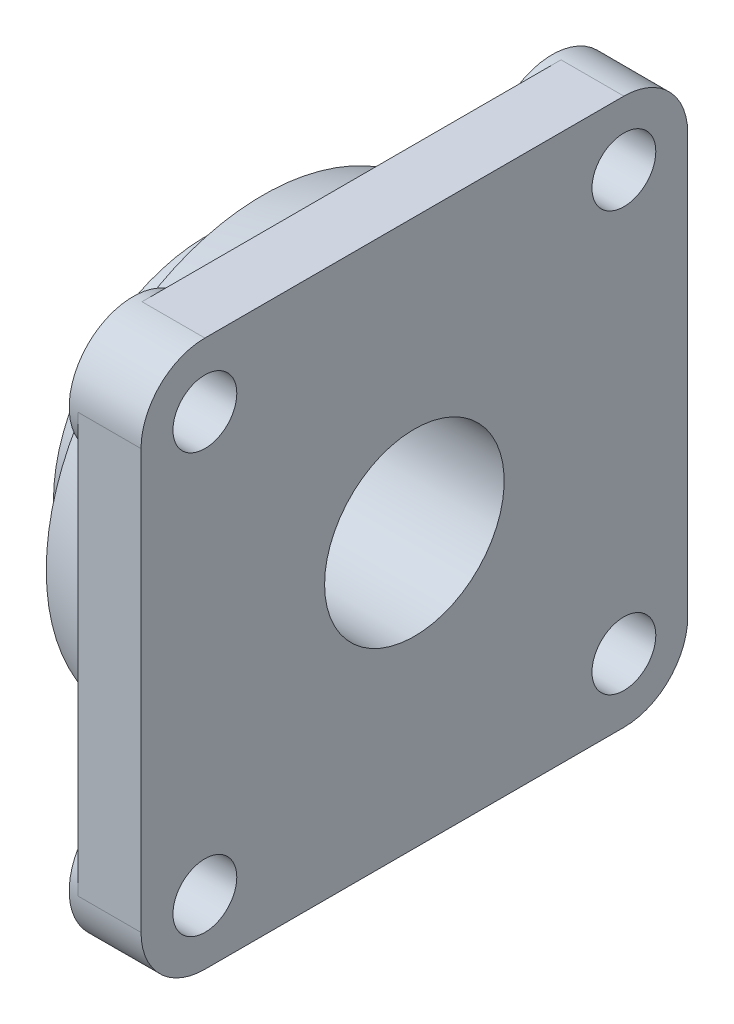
ISO-10303-21;
HEADER;
FILE_DESCRIPTION(('STEP AP214'),'2;1');
FILE_NAME('part.step','',(''),(''),'','','');
FILE_SCHEMA(('AUTOMOTIVE_DESIGN { 1 0 10303 214 1 1 1 1 }'));
ENDSEC;
DATA;
#1=APPLICATION_CONTEXT('core data for automotive mechanical design processes');
#2=APPLICATION_PROTOCOL_DEFINITION('international standard','automotive_design',2000,#1);
#3=PRODUCT_CONTEXT('',#1,'mechanical');
#4=PRODUCT('Part','Part','',(#3));
#5=PRODUCT_RELATED_PRODUCT_CATEGORY('part','',(#4));
#6=PRODUCT_DEFINITION_FORMATION('','',#4);
#7=PRODUCT_DEFINITION_CONTEXT('part definition',#1,'design');
#8=PRODUCT_DEFINITION('design','',#6,#7);
#9=PRODUCT_DEFINITION_SHAPE('','',#8);
#10=(LENGTH_UNIT() NAMED_UNIT(*) SI_UNIT(.MILLI.,.METRE.));
#11=(NAMED_UNIT(*) PLANE_ANGLE_UNIT() SI_UNIT($,.RADIAN.));
#12=(NAMED_UNIT(*) SI_UNIT($,.STERADIAN.) SOLID_ANGLE_UNIT());
#13=UNCERTAINTY_MEASURE_WITH_UNIT(LENGTH_MEASURE(1.E-05),#10,'distance_accuracy_value','');
#14=(GEOMETRIC_REPRESENTATION_CONTEXT(3) GLOBAL_UNCERTAINTY_ASSIGNED_CONTEXT((#13)) GLOBAL_UNIT_ASSIGNED_CONTEXT((#10,
#11,#12)) REPRESENTATION_CONTEXT('',''));
#15=CARTESIAN_POINT('',(0.,0.,0.));
#16=DIRECTION('',(0.,0.,1.));
#17=DIRECTION('',(1.,0.,0.));
#18=AXIS2_PLACEMENT_3D('',#15,#16,#17);
#19=CARTESIAN_POINT('',(-18.,-30.6946330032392,62.6448863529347));
#20=CARTESIAN_POINT('',(-18.,-30.6946330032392,61.6612217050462));
#21=CARTESIAN_POINT('',(-18.,-30.6946330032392,61.5256167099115));
#22=CARTESIAN_POINT('',(-18.,-30.6946330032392,47.9651171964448));
#23=B_SPLINE_CURVE_WITH_KNOTS('',1,(#19,#20,#21,#22),.UNSPECIFIED.,.F.,.F.,(2,1,1,2),
(-0.0825389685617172,-0.01,0.,1.),.UNSPECIFIED.);
#24=DIRECTION('',(0.,1.,0.));
#25=VECTOR('',#24,1.);
#26=SURFACE_OF_LINEAR_EXTRUSION('',#23,#25);
#27=CARTESIAN_POINT('',(-18.,0.,0.));
#28=DIRECTION('',(1.,0.,0.));
#29=DIRECTION('',(0.,0.,-1.));
#30=AXIS2_PLACEMENT_3D('',#27,#28,#29);
#31=CIRCLE('',#30,54.2462120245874);
#32=CARTESIAN_POINT('',(-18.,25.3377001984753,47.9651171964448));
#33=VERTEX_POINT('',#32);
#34=CARTESIAN_POINT('',(-18.,-25.3377001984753,47.9651171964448));
#35=VERTEX_POINT('',#34);
#36=EDGE_CURVE('E20',#33,#35,#31,.T.);
#37=ORIENTED_EDGE('',*,*,#36,.F.);
#38=DIRECTION('',(0.,-0.707106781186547,-0.707106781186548));
#39=VECTOR('',#38,1.);
#40=CARTESIAN_POINT('',(-18.,33.2619958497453,55.8894128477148));
#41=LINE('',#40,#39);
#42=CARTESIAN_POINT('',(-18.,30.6946331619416,53.3220501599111));
#43=VERTEX_POINT('',#42);
#44=EDGE_CURVE('E234',#43,#33,#41,.T.);
#45=ORIENTED_EDGE('',*,*,#44,.F.);
#46=CARTESIAN_POINT('',(-18.,0.,0.));
#47=DIRECTION('',(1.,0.,0.));
#48=DIRECTION('',(0.,0.,-1.));
#49=AXIS2_PLACEMENT_3D('',#46,#47,#48);
#50=CIRCLE('',#49,61.5256167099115);
#51=CARTESIAN_POINT('',(-18.,-30.6946330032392,53.3220500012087));
#52=VERTEX_POINT('',#51);
#53=EDGE_CURVE('E213',#52,#43,#50,.F.);
#54=ORIENTED_EDGE('',*,*,#53,.F.);
#55=DIRECTION('',(0.,-0.707106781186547,0.707106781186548));
#56=VECTOR('',#55,1.);
#57=CARTESIAN_POINT('',(-18.,-33.2619958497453,55.8894128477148));
#58=LINE('',#57,#56);
#59=EDGE_CURVE('E211',#35,#52,#58,.T.);
#60=ORIENTED_EDGE('',*,*,#59,.F.);
#61=EDGE_LOOP('',(#37,#45,#54,#60));
#62=FACE_BOUND('',#61,.T.);
#63=ADVANCED_FACE('F16',(#62),#26,.T.);
#64=CARTESIAN_POINT('',(-15.75,0.,0.));
#65=DIRECTION('',(1.,0.,0.));
#66=DIRECTION('',(0.,0.,-1.));
#67=AXIS2_PLACEMENT_3D('',#64,#65,#66);
#68=CYLINDRICAL_SURFACE('',#67,54.2462120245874);
#69=ORIENTED_EDGE('',*,*,#36,.T.);
#70=DIRECTION('',(1.,0.,0.));
#71=VECTOR('',#70,1.);
#72=CARTESIAN_POINT('',(-18.,-25.3377001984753,47.9651171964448));
#73=LINE('',#72,#71);
#74=CARTESIAN_POINT('',(-15.75,-25.3377001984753,47.9651171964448));
#75=VERTEX_POINT('',#74);
#76=EDGE_CURVE('E205',#75,#35,#73,.F.);
#77=ORIENTED_EDGE('',*,*,#76,.F.);
#78=CARTESIAN_POINT('',(-15.75,0.,0.));
#79=DIRECTION('',(1.,0.,0.));
#80=DIRECTION('',(0.,0.,-1.));
#81=AXIS2_PLACEMENT_3D('',#78,#79,#80);
#82=CIRCLE('',#81,54.2462120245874);
#83=CARTESIAN_POINT('',(-15.75,25.3377001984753,47.9651171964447));
#84=VERTEX_POINT('',#83);
#85=EDGE_CURVE('E375',#84,#75,#82,.T.);
#86=ORIENTED_EDGE('',*,*,#85,.F.);
#87=DIRECTION('',(1.,0.,0.));
#88=VECTOR('',#87,1.);
#89=CARTESIAN_POINT('',(-18.,25.3377001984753,47.9651171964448));
#90=LINE('',#89,#88);
#91=EDGE_CURVE('E207',#33,#84,#90,.T.);
#92=ORIENTED_EDGE('',*,*,#91,.F.);
#93=EDGE_LOOP('',(#69,#77,#86,#92));
#94=FACE_BOUND('',#93,.T.);
#95=ADVANCED_FACE('F202',(#94),#68,.T.);
#96=CARTESIAN_POINT('',(-18.,-61.6069797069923,30.6946330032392));
#97=DIRECTION('',(1.,0.,0.));
#98=DIRECTION('',(0.,0.,-1.));
#99=AXIS2_PLACEMENT_3D('',#96,#97,#98);
#100=PLANE('',#99);
#101=DIRECTION('',(0.,0.707106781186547,-0.707106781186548));
#102=VECTOR('',#101,1.);
#103=CARTESIAN_POINT('',(-18.,-55.8894128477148,33.2619958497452));
#104=LINE('',#103,#102);
#105=CARTESIAN_POINT('',(-18.,-53.3220500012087,30.6946330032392));
#106=VERTEX_POINT('',#105);
#107=CARTESIAN_POINT('',(-18.,-47.9651171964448,25.3377001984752));
#108=VERTEX_POINT('',#107);
#109=EDGE_CURVE('E415',#106,#108,#104,.T.);
#110=ORIENTED_EDGE('',*,*,#109,.F.);
#111=CARTESIAN_POINT('',(-18.,0.,0.));
#112=DIRECTION('',(1.,0.,0.));
#113=DIRECTION('',(0.,0.,-1.));
#114=AXIS2_PLACEMENT_3D('',#111,#112,#113);
#115=CIRCLE('',#114,61.5256167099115);
#116=CARTESIAN_POINT('',(-18.,-53.3220500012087,-30.6946330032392));
#117=VERTEX_POINT('',#116);
#118=EDGE_CURVE('E381',#117,#106,#115,.F.);
#119=ORIENTED_EDGE('',*,*,#118,.F.);
#120=DIRECTION('',(0.,-0.707106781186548,-0.707106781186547));
#121=VECTOR('',#120,1.);
#122=CARTESIAN_POINT('',(-18.,-55.8894128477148,-33.2619958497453));
#123=LINE('',#122,#121);
#124=CARTESIAN_POINT('',(-18.,-47.9651171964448,-25.3377001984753));
#125=VERTEX_POINT('',#124);
#126=EDGE_CURVE('E401',#125,#117,#123,.T.);
#127=ORIENTED_EDGE('',*,*,#126,.F.);
#128=CARTESIAN_POINT('',(-18.,0.,-1.00613961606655E-13));
#129=DIRECTION('',(1.,0.,0.));
#130=DIRECTION('',(0.,0.,-1.));
#131=AXIS2_PLACEMENT_3D('',#128,#129,#130);
#132=CIRCLE('',#131,54.2462120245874);
#133=EDGE_CURVE('E209',#108,#125,#132,.T.);
#134=ORIENTED_EDGE('',*,*,#133,.F.);
#135=EDGE_LOOP('',(#110,#119,#127,#134));
#136=FACE_BOUND('',#135,.T.);
#137=ADVANCED_FACE('F402',(#136),#100,.T.);
#138=CARTESIAN_POINT('',(-15.75,0.,-1.00613961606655E-13));
#139=DIRECTION('',(1.,0.,0.));
#140=DIRECTION('',(0.,0.,-1.));
#141=AXIS2_PLACEMENT_3D('',#138,#139,#140);
#142=CYLINDRICAL_SURFACE('',#141,54.2462120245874);
#143=ORIENTED_EDGE('',*,*,#133,.T.);
#144=DIRECTION('',(1.,0.,0.));
#145=VECTOR('',#144,1.);
#146=CARTESIAN_POINT('',(-18.,-47.9651171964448,-25.3377001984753));
#147=LINE('',#146,#145);
#148=CARTESIAN_POINT('',(-15.75,-47.9651171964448,-25.3377001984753));
#149=VERTEX_POINT('',#148);
#150=EDGE_CURVE('E388',#149,#125,#147,.F.);
#151=ORIENTED_EDGE('',*,*,#150,.F.);
#152=CARTESIAN_POINT('',(-15.75,0.,-1.00613961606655E-13));
#153=DIRECTION('',(1.,0.,0.));
#154=DIRECTION('',(0.,0.,-1.));
#155=AXIS2_PLACEMENT_3D('',#152,#153,#154);
#156=CIRCLE('',#155,54.2462120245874);
#157=CARTESIAN_POINT('',(-15.75,-47.9651171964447,25.3377001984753));
#158=VERTEX_POINT('',#157);
#159=EDGE_CURVE('E367',#158,#149,#156,.T.);
#160=ORIENTED_EDGE('',*,*,#159,.F.);
#161=DIRECTION('',(1.,0.,0.));
#162=VECTOR('',#161,1.);
#163=CARTESIAN_POINT('',(-18.,-47.9651171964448,25.3377001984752));
#164=LINE('',#163,#162);
#165=EDGE_CURVE('E397',#108,#158,#164,.T.);
#166=ORIENTED_EDGE('',*,*,#165,.F.);
#167=EDGE_LOOP('',(#143,#151,#160,#166));
#168=FACE_BOUND('',#167,.T.);
#169=ADVANCED_FACE('F393',(#168),#142,.T.);
#170=CARTESIAN_POINT('',(-18.,-30.6946330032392,-47.9651171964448));
#171=CARTESIAN_POINT('',(-18.,-30.6946330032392,-61.5256167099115));
#172=CARTESIAN_POINT('',(-18.,-30.6946330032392,-61.6612217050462));
#173=CARTESIAN_POINT('',(-18.,-30.6946330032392,-62.6448863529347));
#174=B_SPLINE_CURVE_WITH_KNOTS('',1,(#170,#171,#172,#173),.UNSPECIFIED.,.F.,.F.,(2,1,1,2),(0.,
1.,1.01,1.08253896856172),.UNSPECIFIED.);
#175=DIRECTION('',(0.,1.,0.));
#176=VECTOR('',#175,1.);
#177=SURFACE_OF_LINEAR_EXTRUSION('',#174,#176);
#178=CARTESIAN_POINT('',(-18.,0.,0.));
#179=DIRECTION('',(1.,0.,0.));
#180=DIRECTION('',(0.,0.,-1.));
#181=AXIS2_PLACEMENT_3D('',#178,#179,#180);
#182=CIRCLE('',#181,54.2462120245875);
#183=CARTESIAN_POINT('',(-18.,-25.3377001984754,-47.9651171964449));
#184=VERTEX_POINT('',#183);
#185=CARTESIAN_POINT('',(-18.,25.3377001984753,-47.9651171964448));
#186=VERTEX_POINT('',#185);
#187=EDGE_CURVE('E389',#184,#186,#182,.T.);
#188=ORIENTED_EDGE('',*,*,#187,.F.);
#189=DIRECTION('',(0.,0.707106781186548,0.707106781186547));
#190=VECTOR('',#189,1.);
#191=CARTESIAN_POINT('',(-18.,-33.2619958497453,-55.8894128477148));
#192=LINE('',#191,#190);
#193=CARTESIAN_POINT('',(-18.,-30.6946330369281,-53.3220500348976));
#194=VERTEX_POINT('',#193);
#195=EDGE_CURVE('E715',#194,#184,#192,.T.);
#196=ORIENTED_EDGE('',*,*,#195,.F.);
#197=CARTESIAN_POINT('',(-18.,0.,0.));
#198=DIRECTION('',(1.,0.,0.));
#199=DIRECTION('',(0.,0.,-1.));
#200=AXIS2_PLACEMENT_3D('',#197,#198,#199);
#201=CIRCLE('',#200,61.5256167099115);
#202=CARTESIAN_POINT('',(-18.,30.6946330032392,-53.3220500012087));
#203=VERTEX_POINT('',#202);
#204=EDGE_CURVE('E217',#203,#194,#201,.F.);
#205=ORIENTED_EDGE('',*,*,#204,.F.);
#206=DIRECTION('',(0.,0.707106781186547,-0.707106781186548));
#207=VECTOR('',#206,1.);
#208=CARTESIAN_POINT('',(-18.,33.2619958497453,-55.8894128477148));
#209=LINE('',#208,#207);
#210=EDGE_CURVE('E524',#186,#203,#209,.T.);
#211=ORIENTED_EDGE('',*,*,#210,.F.);
#212=EDGE_LOOP('',(#188,#196,#205,#211));
#213=FACE_BOUND('',#212,.T.);
#214=ADVANCED_FACE('F730',(#213),#177,.T.);
#215=CARTESIAN_POINT('',(-15.75,0.,0.));
#216=DIRECTION('',(1.,0.,0.));
#217=DIRECTION('',(0.,0.,-1.));
#218=AXIS2_PLACEMENT_3D('',#215,#216,#217);
#219=CYLINDRICAL_SURFACE('',#218,54.2462120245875);
#220=ORIENTED_EDGE('',*,*,#187,.T.);
#221=DIRECTION('',(1.,0.,0.));
#222=VECTOR('',#221,1.);
#223=CARTESIAN_POINT('',(-18.,25.3377001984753,-47.9651171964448));
#224=LINE('',#223,#222);
#225=CARTESIAN_POINT('',(-15.75,25.3377001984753,-47.9651171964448));
#226=VERTEX_POINT('',#225);
#227=EDGE_CURVE('E406',#226,#186,#224,.F.);
#228=ORIENTED_EDGE('',*,*,#227,.F.);
#229=CARTESIAN_POINT('',(-15.75,0.,0.));
#230=DIRECTION('',(1.,0.,0.));
#231=DIRECTION('',(0.,0.,-1.));
#232=AXIS2_PLACEMENT_3D('',#229,#230,#231);
#233=CIRCLE('',#232,54.2462120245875);
#234=CARTESIAN_POINT('',(-15.75,-25.3377001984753,-47.9651171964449));
#235=VERTEX_POINT('',#234);
#236=EDGE_CURVE('E358',#235,#226,#233,.T.);
#237=ORIENTED_EDGE('',*,*,#236,.F.);
#238=DIRECTION('',(1.,0.,0.));
#239=VECTOR('',#238,1.);
#240=CARTESIAN_POINT('',(-18.,-25.3377001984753,-47.9651171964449));
#241=LINE('',#240,#239);
#242=EDGE_CURVE('E558',#184,#235,#241,.T.);
#243=ORIENTED_EDGE('',*,*,#242,.F.);
#244=EDGE_LOOP('',(#220,#228,#237,#243));
#245=FACE_BOUND('',#244,.T.);
#246=ADVANCED_FACE('F701',(#245),#219,.T.);
#247=CARTESIAN_POINT('',(-18.,47.8837541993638,30.6946330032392));
#248=DIRECTION('',(1.,0.,0.));
#249=DIRECTION('',(0.,0.,-1.));
#250=AXIS2_PLACEMENT_3D('',#247,#248,#249);
#251=PLANE('',#250);
#252=DIRECTION('',(0.,-0.707106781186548,0.707106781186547));
#253=VECTOR('',#252,1.);
#254=CARTESIAN_POINT('',(-18.,55.8894128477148,-33.2619958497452));
#255=LINE('',#254,#253);
#256=CARTESIAN_POINT('',(-18.,53.3220500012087,-30.6946330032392));
#257=VERTEX_POINT('',#256);
#258=CARTESIAN_POINT('',(-18.,47.9651171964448,-25.3377001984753));
#259=VERTEX_POINT('',#258);
#260=EDGE_CURVE('E527',#257,#259,#255,.T.);
#261=ORIENTED_EDGE('',*,*,#260,.F.);
#262=CARTESIAN_POINT('',(-18.,0.,0.));
#263=DIRECTION('',(1.,0.,0.));
#264=DIRECTION('',(0.,0.,-1.));
#265=AXIS2_PLACEMENT_3D('',#262,#263,#264);
#266=CIRCLE('',#265,61.5256167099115);
#267=CARTESIAN_POINT('',(-18.,53.3220500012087,30.6946330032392));
#268=VERTEX_POINT('',#267);
#269=EDGE_CURVE('E377',#268,#257,#266,.F.);
#270=ORIENTED_EDGE('',*,*,#269,.F.);
#271=DIRECTION('',(0.,0.707106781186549,0.707106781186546));
#272=VECTOR('',#271,1.);
#273=CARTESIAN_POINT('',(-18.,55.8894128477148,33.2619958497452));
#274=LINE('',#273,#272);
#275=CARTESIAN_POINT('',(-18.,47.9651171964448,25.3377001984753));
#276=VERTEX_POINT('',#275);
#277=EDGE_CURVE('E223',#276,#268,#274,.T.);
#278=ORIENTED_EDGE('',*,*,#277,.F.);
#279=CARTESIAN_POINT('',(-18.,0.,0.));
#280=DIRECTION('',(1.,0.,0.));
#281=DIRECTION('',(0.,0.,-1.));
#282=AXIS2_PLACEMENT_3D('',#279,#280,#281);
#283=CIRCLE('',#282,54.2462120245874);
#284=EDGE_CURVE('E386',#259,#276,#283,.T.);
#285=ORIENTED_EDGE('',*,*,#284,.F.);
#286=EDGE_LOOP('',(#261,#270,#278,#285));
#287=FACE_BOUND('',#286,.T.);
#288=ADVANCED_FACE('F830',(#287),#251,.T.);
#289=CARTESIAN_POINT('',(-15.75,0.,0.));
#290=DIRECTION('',(1.,0.,0.));
#291=DIRECTION('',(0.,0.,-1.));
#292=AXIS2_PLACEMENT_3D('',#289,#290,#291);
#293=CYLINDRICAL_SURFACE('',#292,54.2462120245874);
#294=ORIENTED_EDGE('',*,*,#284,.T.);
#295=DIRECTION('',(1.,0.,0.));
#296=VECTOR('',#295,1.);
#297=CARTESIAN_POINT('',(-18.,47.9651171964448,25.3377001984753));
#298=LINE('',#297,#296);
#299=CARTESIAN_POINT('',(-15.75,47.9651171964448,25.3377001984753));
#300=VERTEX_POINT('',#299);
#301=EDGE_CURVE('E226',#300,#276,#298,.F.);
#302=ORIENTED_EDGE('',*,*,#301,.F.);
#303=CARTESIAN_POINT('',(-15.75,0.,0.));
#304=DIRECTION('',(1.,0.,0.));
#305=DIRECTION('',(0.,0.,-1.));
#306=AXIS2_PLACEMENT_3D('',#303,#304,#305);
#307=CIRCLE('',#306,54.2462120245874);
#308=CARTESIAN_POINT('',(-15.75,47.9651171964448,-25.3377001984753));
#309=VERTEX_POINT('',#308);
#310=EDGE_CURVE('E349',#309,#300,#307,.T.);
#311=ORIENTED_EDGE('',*,*,#310,.F.);
#312=DIRECTION('',(1.,0.,0.));
#313=VECTOR('',#312,1.);
#314=CARTESIAN_POINT('',(-18.,47.9651171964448,-25.3377001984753));
#315=LINE('',#314,#313);
#316=EDGE_CURVE('E525',#259,#309,#315,.T.);
#317=ORIENTED_EDGE('',*,*,#316,.F.);
#318=EDGE_LOOP('',(#294,#302,#311,#317));
#319=FACE_BOUND('',#318,.T.);
#320=ADVANCED_FACE('F828',(#319),#293,.T.);
#321=CARTESIAN_POINT('',(-18.,-47.9651171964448,-25.3377001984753));
#322=DIRECTION('',(0.,-0.707106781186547,0.707106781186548));
#323=DIRECTION('',(0.,-0.707106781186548,-0.707106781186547));
#324=AXIS2_PLACEMENT_3D('',#321,#322,#323);
#325=PLANE('',#324);
#326=CARTESIAN_POINT('',(-18.,-63.8137084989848,-41.1862915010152));
#327=CARTESIAN_POINT('',(-18.,-63.3765560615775,-40.7491390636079));
#328=CARTESIAN_POINT('',(-18.,-62.9394036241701,-40.3119866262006));
#329=CARTESIAN_POINT('',(-18.,-62.0650987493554,-39.4376817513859));
#330=CARTESIAN_POINT('',(-18.,-61.6279463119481,-39.0005293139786));
#331=CARTESIAN_POINT('',(-18.,-60.7536414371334,-38.1262244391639));
#332=CARTESIAN_POINT('',(-18.,-60.3164889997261,-37.6890720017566));
#333=CARTESIAN_POINT('',(-18.,-59.4421841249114,-36.8147671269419));
#334=CARTESIAN_POINT('',(-18.,-59.0050316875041,-36.3776146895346));
#335=CARTESIAN_POINT('',(-18.,-58.1307268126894,-35.5033098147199));
#336=CARTESIAN_POINT('',(-18.,-57.6935743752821,-35.0661573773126));
#337=CARTESIAN_POINT('',(-18.,-56.8192695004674,-34.1918525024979));
#338=CARTESIAN_POINT('',(-18.,-56.3821170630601,-33.7547000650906));
#339=CARTESIAN_POINT('',(-18.,-55.5078121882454,-32.8803951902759));
#340=CARTESIAN_POINT('',(-18.,-55.0706597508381,-32.4432427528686));
#341=CARTESIAN_POINT('',(-18.,-54.1963548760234,-31.5689378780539));
#342=CARTESIAN_POINT('',(-18.,-53.7592024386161,-31.1317854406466));
#343=CARTESIAN_POINT('',(-18.,-53.3220500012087,-30.6946330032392));
#344=B_SPLINE_CURVE_WITH_KNOTS('',3,(#326,#327,#328,#329,#330,#331,#332,#333,#334,#335,#336,
#337,#338,#339,#340,#341,#342,#343),.UNSPECIFIED.,.F.,.F.,(4,2,2,2,2,2,2,2,4),(0.,
1.85468071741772,3.70936143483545,5.56404215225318,7.41872286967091,9.27340358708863,
11.1280843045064,12.9827650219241,14.8374457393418),.UNSPECIFIED.);
#345=CARTESIAN_POINT('',(-18.,-63.8137084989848,-41.1862915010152));
#346=VERTEX_POINT('',#345);
#347=EDGE_CURVE('E345',#346,#117,#344,.T.);
#348=ORIENTED_EDGE('',*,*,#347,.F.);
#349=DIRECTION('',(-1.,0.,0.));
#350=VECTOR('',#349,1.);
#351=CARTESIAN_POINT('',(-16.875,-63.8137084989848,-41.1862915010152));
#352=LINE('',#351,#350);
#353=CARTESIAN_POINT('',(-15.75,-63.8137084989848,-41.1862915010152));
#354=VERTEX_POINT('',#353);
#355=EDGE_CURVE('E365',#354,#346,#352,.T.);
#356=ORIENTED_EDGE('',*,*,#355,.F.);
#357=CARTESIAN_POINT('',(-15.75,-47.9651171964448,-25.3377001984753));
#358=CARTESIAN_POINT('',(-15.75,-48.625475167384,-25.9980581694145));
#359=CARTESIAN_POINT('',(-15.75,-49.2858331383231,-26.6584161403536));
#360=CARTESIAN_POINT('',(-15.75,-50.6065490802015,-27.979132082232));
#361=CARTESIAN_POINT('',(-15.75,-51.2669070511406,-28.6394900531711));
#362=CARTESIAN_POINT('',(-15.75,-52.587622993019,-29.9602059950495));
#363=CARTESIAN_POINT('',(-15.75,-53.2479809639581,-30.6205639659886));
#364=CARTESIAN_POINT('',(-15.75,-54.5686969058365,-31.941279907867));
#365=CARTESIAN_POINT('',(-15.75,-55.2290548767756,-32.6016378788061));
#366=CARTESIAN_POINT('',(-15.75,-56.549770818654,-33.9223538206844));
#367=CARTESIAN_POINT('',(-15.75,-57.2101287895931,-34.5827117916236));
#368=CARTESIAN_POINT('',(-15.75,-58.5308447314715,-35.9034277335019));
#369=CARTESIAN_POINT('',(-15.75,-59.1912027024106,-36.5637857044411));
#370=CARTESIAN_POINT('',(-15.75,-60.5119186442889,-37.8845016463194));
#371=CARTESIAN_POINT('',(-15.75,-61.1722766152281,-38.5448596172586));
#372=CARTESIAN_POINT('',(-15.75,-62.4929925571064,-39.8655755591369));
#373=CARTESIAN_POINT('',(-15.75,-63.1533505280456,-40.5259335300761));
#374=CARTESIAN_POINT('',(-15.75,-63.8137084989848,-41.1862915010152));
#375=B_SPLINE_CURVE_WITH_KNOTS('',3,(#357,#358,#359,#360,#361,#362,#363,#364,#365,#366,#367,
#368,#369,#370,#371,#372,#373,#374),.UNSPECIFIED.,.F.,.F.,(4,2,2,2,2,2,2,2,4),(0.,
2.80166159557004,5.60332319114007,8.40498478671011,11.2066463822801,14.0083079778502,
16.8099695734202,19.6116311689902,22.4132927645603),.UNSPECIFIED.);
#376=EDGE_CURVE('E366',#149,#354,#375,.T.);
#377=ORIENTED_EDGE('',*,*,#376,.F.);
#378=ORIENTED_EDGE('',*,*,#150,.T.);
#379=ORIENTED_EDGE('',*,*,#126,.T.);
#380=EDGE_LOOP('',(#348,#356,#377,#378,#379));
#381=FACE_BOUND('',#380,.T.);
#382=ADVANCED_FACE('F408',(#381),#325,.T.);
#383=CARTESIAN_POINT('',(-18.,25.3377001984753,-47.9651171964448));
#384=DIRECTION('',(0.,-0.707106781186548,-0.707106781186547));
#385=DIRECTION('',(0.,0.707106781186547,-0.707106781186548));
#386=AXIS2_PLACEMENT_3D('',#383,#384,#385);
#387=PLANE('',#386);
#388=CARTESIAN_POINT('',(-18.,41.1862915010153,-63.8137084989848));
#389=CARTESIAN_POINT('',(-18.,40.7491390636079,-63.3765560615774));
#390=CARTESIAN_POINT('',(-18.,40.3119866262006,-62.9394036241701));
#391=CARTESIAN_POINT('',(-18.,39.4376817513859,-62.0650987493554));
#392=CARTESIAN_POINT('',(-18.,39.0005293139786,-61.6279463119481));
#393=CARTESIAN_POINT('',(-18.,38.1262244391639,-60.7536414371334));
#394=CARTESIAN_POINT('',(-18.,37.6890720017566,-60.3164889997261));
#395=CARTESIAN_POINT('',(-18.,36.8147671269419,-59.4421841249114));
#396=CARTESIAN_POINT('',(-18.,36.3776146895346,-59.0050316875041));
#397=CARTESIAN_POINT('',(-18.,35.5033098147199,-58.1307268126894));
#398=CARTESIAN_POINT('',(-18.,35.0661573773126,-57.6935743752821));
#399=CARTESIAN_POINT('',(-18.,34.1918525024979,-56.8192695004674));
#400=CARTESIAN_POINT('',(-18.,33.7547000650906,-56.3821170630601));
#401=CARTESIAN_POINT('',(-18.,32.8803951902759,-55.5078121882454));
#402=CARTESIAN_POINT('',(-18.,32.4432427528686,-55.070659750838));
#403=CARTESIAN_POINT('',(-18.,31.5689378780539,-54.1963548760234));
#404=CARTESIAN_POINT('',(-18.,31.1317854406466,-53.759202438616));
#405=CARTESIAN_POINT('',(-18.,30.6946330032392,-53.3220500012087));
#406=B_SPLINE_CURVE_WITH_KNOTS('',3,(#388,#389,#390,#391,#392,#393,#394,#395,#396,#397,#398,
#399,#400,#401,#402,#403,#404,#405),.UNSPECIFIED.,.F.,.F.,(4,2,2,2,2,2,2,2,4),(0.,
1.85468071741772,3.70936143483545,5.56404215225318,7.41872286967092,9.27340358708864,
11.1280843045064,12.9827650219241,14.8374457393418),.UNSPECIFIED.);
#407=CARTESIAN_POINT('',(-18.,41.1862915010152,-63.8137084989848));
#408=VERTEX_POINT('',#407);
#409=EDGE_CURVE('E340',#408,#203,#406,.T.);
#410=ORIENTED_EDGE('',*,*,#409,.F.);
#411=DIRECTION('',(-1.,0.,0.));
#412=VECTOR('',#411,1.);
#413=CARTESIAN_POINT('',(-16.875,41.1862915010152,-63.8137084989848));
#414=LINE('',#413,#412);
#415=CARTESIAN_POINT('',(-15.75,41.1862915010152,-63.8137084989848));
#416=VERTEX_POINT('',#415);
#417=EDGE_CURVE('E356',#416,#408,#414,.T.);
#418=ORIENTED_EDGE('',*,*,#417,.F.);
#419=CARTESIAN_POINT('',(-15.75,25.3377001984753,-47.9651171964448));
#420=CARTESIAN_POINT('',(-15.75,25.9980581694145,-48.625475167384));
#421=CARTESIAN_POINT('',(-15.75,26.6584161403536,-49.2858331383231));
#422=CARTESIAN_POINT('',(-15.75,27.979132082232,-50.6065490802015));
#423=CARTESIAN_POINT('',(-15.75,28.6394900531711,-51.2669070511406));
#424=CARTESIAN_POINT('',(-15.75,29.9602059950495,-52.5876229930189));
#425=CARTESIAN_POINT('',(-15.75,30.6205639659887,-53.2479809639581));
#426=CARTESIAN_POINT('',(-15.75,31.941279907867,-54.5686969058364));
#427=CARTESIAN_POINT('',(-15.75,32.6016378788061,-55.2290548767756));
#428=CARTESIAN_POINT('',(-15.75,33.9223538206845,-56.5497708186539));
#429=CARTESIAN_POINT('',(-15.75,34.5827117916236,-57.2101287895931));
#430=CARTESIAN_POINT('',(-15.75,35.903427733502,-58.5308447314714));
#431=CARTESIAN_POINT('',(-15.75,36.5637857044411,-59.1912027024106));
#432=CARTESIAN_POINT('',(-15.75,37.8845016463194,-60.5119186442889));
#433=CARTESIAN_POINT('',(-15.75,38.5448596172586,-61.1722766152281));
#434=CARTESIAN_POINT('',(-15.75,39.8655755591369,-62.4929925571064));
#435=CARTESIAN_POINT('',(-15.75,40.5259335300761,-63.1533505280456));
#436=CARTESIAN_POINT('',(-15.75,41.1862915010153,-63.8137084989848));
#437=B_SPLINE_CURVE_WITH_KNOTS('',3,(#419,#420,#421,#422,#423,#424,#425,#426,#427,#428,#429,
#430,#431,#432,#433,#434,#435,#436),.UNSPECIFIED.,.F.,.F.,(4,2,2,2,2,2,2,2,4),(0.,
2.80166159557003,5.60332319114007,8.40498478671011,11.2066463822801,14.0083079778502,
16.8099695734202,19.6116311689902,22.4132927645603),.UNSPECIFIED.);
#438=EDGE_CURVE('E357',#226,#416,#437,.T.);
#439=ORIENTED_EDGE('',*,*,#438,.F.);
#440=ORIENTED_EDGE('',*,*,#227,.T.);
#441=ORIENTED_EDGE('',*,*,#210,.T.);
#442=EDGE_LOOP('',(#410,#418,#439,#440,#441));
#443=FACE_BOUND('',#442,.T.);
#444=ADVANCED_FACE('F707',(#443),#387,.T.);
#445=CARTESIAN_POINT('',(-18.,47.9651171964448,25.3377001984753));
#446=DIRECTION('',(0.,0.707106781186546,-0.707106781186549));
#447=DIRECTION('',(0.,0.707106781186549,0.707106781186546));
#448=AXIS2_PLACEMENT_3D('',#445,#446,#447);
#449=PLANE('',#448);
#450=CARTESIAN_POINT('',(-18.,63.8137084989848,41.1862915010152));
#451=CARTESIAN_POINT('',(-18.,63.3765560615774,40.7491390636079));
#452=CARTESIAN_POINT('',(-18.,62.9394036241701,40.3119866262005));
#453=CARTESIAN_POINT('',(-18.,62.0650987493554,39.4376817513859));
#454=CARTESIAN_POINT('',(-18.,61.6279463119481,39.0005293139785));
#455=CARTESIAN_POINT('',(-18.,60.7536414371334,38.1262244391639));
#456=CARTESIAN_POINT('',(-18.,60.3164889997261,37.6890720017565));
#457=CARTESIAN_POINT('',(-18.,59.4421841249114,36.8147671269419));
#458=CARTESIAN_POINT('',(-18.,59.0050316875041,36.3776146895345));
#459=CARTESIAN_POINT('',(-18.,58.1307268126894,35.5033098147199));
#460=CARTESIAN_POINT('',(-18.,57.6935743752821,35.0661573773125));
#461=CARTESIAN_POINT('',(-18.,56.8192695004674,34.1918525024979));
#462=CARTESIAN_POINT('',(-18.,56.3821170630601,33.7547000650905));
#463=CARTESIAN_POINT('',(-18.,55.5078121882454,32.8803951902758));
#464=CARTESIAN_POINT('',(-18.,55.0706597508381,32.4432427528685));
#465=CARTESIAN_POINT('',(-18.,54.1963548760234,31.5689378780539));
#466=CARTESIAN_POINT('',(-18.,53.7592024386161,31.1317854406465));
#467=CARTESIAN_POINT('',(-18.,53.3220500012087,30.6946330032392));
#468=B_SPLINE_CURVE_WITH_KNOTS('',3,(#450,#451,#452,#453,#454,#455,#456,#457,#458,#459,#460,
#461,#462,#463,#464,#465,#466,#467),.UNSPECIFIED.,.F.,.F.,(4,2,2,2,2,2,2,2,4),(0.,
1.85468071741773,3.70936143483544,5.56404215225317,7.4187228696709,9.27340358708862,
11.1280843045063,12.9827650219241,14.8374457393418),.UNSPECIFIED.);
#469=CARTESIAN_POINT('',(-18.,63.8137084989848,41.1862915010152));
#470=VERTEX_POINT('',#469);
#471=EDGE_CURVE('E335',#470,#268,#468,.T.);
#472=ORIENTED_EDGE('',*,*,#471,.F.);
#473=DIRECTION('',(-1.,0.,0.));
#474=VECTOR('',#473,1.);
#475=CARTESIAN_POINT('',(-16.875,63.8137084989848,41.1862915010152));
#476=LINE('',#475,#474);
#477=CARTESIAN_POINT('',(-15.75,63.8137084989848,41.1862915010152));
#478=VERTEX_POINT('',#477);
#479=EDGE_CURVE('E379',#478,#470,#476,.T.);
#480=ORIENTED_EDGE('',*,*,#479,.F.);
#481=CARTESIAN_POINT('',(-15.75,47.9651171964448,25.3377001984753));
#482=CARTESIAN_POINT('',(-15.75,48.625475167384,25.9980581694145));
#483=CARTESIAN_POINT('',(-15.75,49.2858331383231,26.6584161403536));
#484=CARTESIAN_POINT('',(-15.75,50.6065490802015,27.9791320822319));
#485=CARTESIAN_POINT('',(-15.75,51.2669070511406,28.6394900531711));
#486=CARTESIAN_POINT('',(-15.75,52.587622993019,29.9602059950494));
#487=CARTESIAN_POINT('',(-15.75,53.2479809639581,30.6205639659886));
#488=CARTESIAN_POINT('',(-15.75,54.5686969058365,31.9412799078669));
#489=CARTESIAN_POINT('',(-15.75,55.2290548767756,32.6016378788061));
#490=CARTESIAN_POINT('',(-15.75,56.549770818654,33.9223538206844));
#491=CARTESIAN_POINT('',(-15.75,57.2101287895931,34.5827117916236));
#492=CARTESIAN_POINT('',(-15.75,58.5308447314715,35.9034277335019));
#493=CARTESIAN_POINT('',(-15.75,59.1912027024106,36.5637857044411));
#494=CARTESIAN_POINT('',(-15.75,60.511918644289,37.8845016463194));
#495=CARTESIAN_POINT('',(-15.75,61.1722766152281,38.5448596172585));
#496=CARTESIAN_POINT('',(-15.75,62.4929925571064,39.8655755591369));
#497=CARTESIAN_POINT('',(-15.75,63.1533505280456,40.525933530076));
#498=CARTESIAN_POINT('',(-15.75,63.8137084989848,41.1862915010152));
#499=B_SPLINE_CURVE_WITH_KNOTS('',3,(#481,#482,#483,#484,#485,#486,#487,#488,#489,#490,#491,
#492,#493,#494,#495,#496,#497,#498),.UNSPECIFIED.,.F.,.F.,(4,2,2,2,2,2,2,2,4),(0.,
2.80166159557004,5.60332319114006,8.40498478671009,11.2066463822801,14.0083079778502,
16.8099695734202,19.6116311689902,22.4132927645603),.UNSPECIFIED.);
#500=EDGE_CURVE('E348',#300,#478,#499,.T.);
#501=ORIENTED_EDGE('',*,*,#500,.F.);
#502=ORIENTED_EDGE('',*,*,#301,.T.);
#503=ORIENTED_EDGE('',*,*,#277,.T.);
#504=EDGE_LOOP('',(#472,#480,#501,#502,#503));
#505=FACE_BOUND('',#504,.T.);
#506=ADVANCED_FACE('F635',(#505),#449,.T.);
#507=CARTESIAN_POINT('',(-18.,-25.3377001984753,47.9651171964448));
#508=DIRECTION('',(0.,0.707106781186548,0.707106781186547));
#509=DIRECTION('',(0.,-0.707106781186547,0.707106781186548));
#510=AXIS2_PLACEMENT_3D('',#507,#508,#509);
#511=PLANE('',#510);
#512=CARTESIAN_POINT('',(-18.,-41.1862915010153,63.8137084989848));
#513=CARTESIAN_POINT('',(-18.,-40.7491390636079,63.3765560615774));
#514=CARTESIAN_POINT('',(-18.,-40.3119866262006,62.9394036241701));
#515=CARTESIAN_POINT('',(-18.,-39.4376817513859,62.0650987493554));
#516=CARTESIAN_POINT('',(-18.,-39.0005293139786,61.6279463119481));
#517=CARTESIAN_POINT('',(-18.,-38.1262244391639,60.7536414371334));
#518=CARTESIAN_POINT('',(-18.,-37.6890720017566,60.3164889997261));
#519=CARTESIAN_POINT('',(-18.,-36.8147671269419,59.4421841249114));
#520=CARTESIAN_POINT('',(-18.,-36.3776146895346,59.0050316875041));
#521=CARTESIAN_POINT('',(-18.,-35.5033098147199,58.1307268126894));
#522=CARTESIAN_POINT('',(-18.,-35.0661573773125,57.6935743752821));
#523=CARTESIAN_POINT('',(-18.,-34.1918525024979,56.8192695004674));
#524=CARTESIAN_POINT('',(-18.,-33.7547000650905,56.3821170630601));
#525=CARTESIAN_POINT('',(-18.,-32.8803951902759,55.5078121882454));
#526=CARTESIAN_POINT('',(-18.,-32.4432427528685,55.0706597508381));
#527=CARTESIAN_POINT('',(-18.,-31.5689378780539,54.1963548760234));
#528=CARTESIAN_POINT('',(-18.,-31.1317854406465,53.7592024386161));
#529=CARTESIAN_POINT('',(-18.,-30.6946330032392,53.3220500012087));
#530=B_SPLINE_CURVE_WITH_KNOTS('',3,(#512,#513,#514,#515,#516,#517,#518,#519,#520,#521,#522,
#523,#524,#525,#526,#527,#528,#529),.UNSPECIFIED.,.F.,.F.,(4,2,2,2,2,2,2,2,4),(0.,
1.85468071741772,3.70936143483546,5.56404215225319,7.41872286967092,9.27340358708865,
11.1280843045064,12.9827650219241,14.8374457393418),.UNSPECIFIED.);
#531=CARTESIAN_POINT('',(-18.,-41.1862915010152,63.8137084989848));
#532=VERTEX_POINT('',#531);
#533=EDGE_CURVE('E331',#532,#52,#530,.T.);
#534=ORIENTED_EDGE('',*,*,#533,.F.);
#535=DIRECTION('',(-1.,0.,0.));
#536=VECTOR('',#535,1.);
#537=CARTESIAN_POINT('',(-16.875,-41.1862915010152,63.8137084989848));
#538=LINE('',#537,#536);
#539=CARTESIAN_POINT('',(-15.75,-41.1862915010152,63.8137084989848));
#540=VERTEX_POINT('',#539);
#541=EDGE_CURVE('E374',#540,#532,#538,.T.);
#542=ORIENTED_EDGE('',*,*,#541,.F.);
#543=CARTESIAN_POINT('',(-15.75,-25.3377001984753,47.9651171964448));
#544=CARTESIAN_POINT('',(-15.75,-25.9980581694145,48.6254751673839));
#545=CARTESIAN_POINT('',(-15.75,-26.6584161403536,49.2858331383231));
#546=CARTESIAN_POINT('',(-15.75,-27.979132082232,50.6065490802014));
#547=CARTESIAN_POINT('',(-15.75,-28.6394900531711,51.2669070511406));
#548=CARTESIAN_POINT('',(-15.75,-29.9602059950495,52.5876229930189));
#549=CARTESIAN_POINT('',(-15.75,-30.6205639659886,53.2479809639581));
#550=CARTESIAN_POINT('',(-15.75,-31.941279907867,54.5686969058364));
#551=CARTESIAN_POINT('',(-15.75,-32.6016378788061,55.2290548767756));
#552=CARTESIAN_POINT('',(-15.75,-33.9223538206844,56.5497708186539));
#553=CARTESIAN_POINT('',(-15.75,-34.5827117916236,57.2101287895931));
#554=CARTESIAN_POINT('',(-15.75,-35.9034277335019,58.5308447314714));
#555=CARTESIAN_POINT('',(-15.75,-36.5637857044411,59.1912027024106));
#556=CARTESIAN_POINT('',(-15.75,-37.8845016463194,60.5119186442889));
#557=CARTESIAN_POINT('',(-15.75,-38.5448596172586,61.1722766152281));
#558=CARTESIAN_POINT('',(-15.75,-39.8655755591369,62.4929925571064));
#559=CARTESIAN_POINT('',(-15.75,-40.5259335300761,63.1533505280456));
#560=CARTESIAN_POINT('',(-15.75,-41.1862915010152,63.8137084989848));
#561=B_SPLINE_CURVE_WITH_KNOTS('',3,(#543,#544,#545,#546,#547,#548,#549,#550,#551,#552,#553,
#554,#555,#556,#557,#558,#559,#560),.UNSPECIFIED.,.F.,.F.,(4,2,2,2,2,2,2,2,4),(0.,
2.80166159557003,5.60332319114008,8.40498478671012,11.2066463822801,14.0083079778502,
16.8099695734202,19.6116311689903,22.4132927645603),.UNSPECIFIED.);
#562=EDGE_CURVE('E221',#75,#540,#561,.T.);
#563=ORIENTED_EDGE('',*,*,#562,.F.);
#564=ORIENTED_EDGE('',*,*,#76,.T.);
#565=ORIENTED_EDGE('',*,*,#59,.T.);
#566=EDGE_LOOP('',(#534,#542,#563,#564,#565));
#567=FACE_BOUND('',#566,.T.);
#568=ADVANCED_FACE('F219',(#567),#511,.T.);
#569=CARTESIAN_POINT('',(-38.,0.,0.));
#570=DIRECTION('',(1.,0.,0.));
#571=DIRECTION('',(0.,0.,-1.));
#572=AXIS2_PLACEMENT_3D('',#569,#570,#571);
#573=CONICAL_SURFACE('',#572,54.2462120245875,0.349065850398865);
#574=CARTESIAN_POINT('',(-38.,0.,0.));
#575=DIRECTION('',(1.,0.,0.));
#576=DIRECTION('',(0.,0.,-1.));
#577=AXIS2_PLACEMENT_3D('',#574,#575,#576);
#578=CIRCLE('',#577,54.2462120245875);
#579=CARTESIAN_POINT('',(-38.,0.,-54.2462120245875));
#580=VERTEX_POINT('',#579);
#581=EDGE_CURVE('E324',#580,#580,#578,.F.);
#582=ORIENTED_EDGE('',*,*,#581,.F.);
#583=EDGE_LOOP('',(#582));
#584=FACE_BOUND('',#583,.T.);
#585=CARTESIAN_POINT('',(-18.,0.,0.));
#586=DIRECTION('',(1.,0.,0.));
#587=DIRECTION('',(0.,0.,-1.));
#588=AXIS2_PLACEMENT_3D('',#585,#586,#587);
#589=CIRCLE('',#588,61.5256167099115);
#590=EDGE_CURVE('E332',#268,#43,#589,.T.);
#591=ORIENTED_EDGE('',*,*,#590,.F.);
#592=ORIENTED_EDGE('',*,*,#269,.T.);
#593=CARTESIAN_POINT('',(-18.,0.,0.));
#594=DIRECTION('',(1.,0.,0.));
#595=DIRECTION('',(0.,0.,-1.));
#596=AXIS2_PLACEMENT_3D('',#593,#594,#595);
#597=CIRCLE('',#596,61.5256167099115);
#598=EDGE_CURVE('E336',#203,#257,#597,.T.);
#599=ORIENTED_EDGE('',*,*,#598,.F.);
#600=ORIENTED_EDGE('',*,*,#204,.T.);
#601=CARTESIAN_POINT('',(-18.,0.,0.));
#602=DIRECTION('',(1.,0.,0.));
#603=DIRECTION('',(0.,0.,-1.));
#604=AXIS2_PLACEMENT_3D('',#601,#602,#603);
#605=CIRCLE('',#604,61.5256167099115);
#606=EDGE_CURVE('E341',#117,#194,#605,.T.);
#607=ORIENTED_EDGE('',*,*,#606,.F.);
#608=ORIENTED_EDGE('',*,*,#118,.T.);
#609=CARTESIAN_POINT('',(-18.,0.,0.));
#610=DIRECTION('',(1.,0.,0.));
#611=DIRECTION('',(0.,0.,-1.));
#612=AXIS2_PLACEMENT_3D('',#609,#610,#611);
#613=CIRCLE('',#612,61.5256167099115);
#614=EDGE_CURVE('E328',#52,#106,#613,.T.);
#615=ORIENTED_EDGE('',*,*,#614,.F.);
#616=ORIENTED_EDGE('',*,*,#53,.T.);
#617=EDGE_LOOP('',(#591,#592,#599,#600,#607,#608,#615,#616));
#618=FACE_BOUND('',#617,.T.);
#619=ADVANCED_FACE('F639',(#584,#618),#573,.T.);
#620=CARTESIAN_POINT('',(-18.,41.1862915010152,63.8137084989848));
#621=DIRECTION('',(0.,-0.707106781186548,0.707106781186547));
#622=DIRECTION('',(0.,-0.707106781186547,-0.707106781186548));
#623=AXIS2_PLACEMENT_3D('',#620,#621,#622);
#624=PLANE('',#623);
#625=ORIENTED_EDGE('',*,*,#44,.T.);
#626=ORIENTED_EDGE('',*,*,#91,.T.);
#627=CARTESIAN_POINT('',(-15.75,41.1862915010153,63.8137084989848));
#628=CARTESIAN_POINT('',(-15.75,40.5259335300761,63.1533505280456));
#629=CARTESIAN_POINT('',(-15.75,39.8655755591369,62.4929925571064));
#630=CARTESIAN_POINT('',(-15.75,38.5448596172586,61.1722766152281));
#631=CARTESIAN_POINT('',(-15.75,37.8845016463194,60.5119186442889));
#632=CARTESIAN_POINT('',(-15.75,36.5637857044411,59.1912027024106));
#633=CARTESIAN_POINT('',(-15.75,35.9034277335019,58.5308447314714));
#634=CARTESIAN_POINT('',(-15.75,34.5827117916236,57.2101287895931));
#635=CARTESIAN_POINT('',(-15.75,33.9223538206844,56.5497708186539));
#636=CARTESIAN_POINT('',(-15.75,32.6016378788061,55.2290548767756));
#637=CARTESIAN_POINT('',(-15.75,31.9412799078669,54.5686969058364));
#638=CARTESIAN_POINT('',(-15.75,30.6205639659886,53.2479809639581));
#639=CARTESIAN_POINT('',(-15.75,29.9602059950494,52.5876229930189));
#640=CARTESIAN_POINT('',(-15.75,28.6394900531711,51.2669070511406));
#641=CARTESIAN_POINT('',(-15.75,27.9791320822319,50.6065490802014));
#642=CARTESIAN_POINT('',(-15.75,26.6584161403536,49.2858331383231));
#643=CARTESIAN_POINT('',(-15.75,25.9980581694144,48.6254751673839));
#644=CARTESIAN_POINT('',(-15.75,25.3377001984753,47.9651171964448));
#645=B_SPLINE_CURVE_WITH_KNOTS('',3,(#627,#628,#629,#630,#631,#632,#633,#634,#635,#636,#637,
#638,#639,#640,#641,#642,#643,#644),.UNSPECIFIED.,.F.,.F.,(4,2,2,2,2,2,2,2,4),(0.,
2.80166159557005,5.60332319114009,8.40498478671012,11.2066463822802,14.0083079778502,
16.8099695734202,19.6116311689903,22.4132927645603),.UNSPECIFIED.);
#646=CARTESIAN_POINT('',(-15.75,41.1862915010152,63.8137084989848));
#647=VERTEX_POINT('',#646);
#648=EDGE_CURVE('E233',#647,#84,#645,.T.);
#649=ORIENTED_EDGE('',*,*,#648,.F.);
#650=DIRECTION('',(1.,0.,0.));
#651=VECTOR('',#650,1.);
#652=CARTESIAN_POINT('',(-9.,41.1862915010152,63.8137084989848));
#653=LINE('',#652,#651);
#654=CARTESIAN_POINT('',(-18.,41.1862915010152,63.8137084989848));
#655=VERTEX_POINT('',#654);
#656=EDGE_CURVE('E320',#655,#647,#653,.T.);
#657=ORIENTED_EDGE('',*,*,#656,.F.);
#658=CARTESIAN_POINT('',(-18.,30.6946330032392,53.3220500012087));
#659=CARTESIAN_POINT('',(-18.,31.1317854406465,53.759202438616));
#660=CARTESIAN_POINT('',(-18.,31.5689378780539,54.1963548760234));
#661=CARTESIAN_POINT('',(-18.,32.4432427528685,55.070659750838));
#662=CARTESIAN_POINT('',(-18.,32.8803951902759,55.5078121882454));
#663=CARTESIAN_POINT('',(-18.,33.7547000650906,56.3821170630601));
#664=CARTESIAN_POINT('',(-18.,34.1918525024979,56.8192695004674));
#665=CARTESIAN_POINT('',(-18.,35.0661573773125,57.6935743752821));
#666=CARTESIAN_POINT('',(-18.,35.5033098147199,58.1307268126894));
#667=CARTESIAN_POINT('',(-18.,36.3776146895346,59.0050316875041));
#668=CARTESIAN_POINT('',(-18.,36.8147671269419,59.4421841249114));
#669=CARTESIAN_POINT('',(-18.,37.6890720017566,60.3164889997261));
#670=CARTESIAN_POINT('',(-18.,38.1262244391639,60.7536414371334));
#671=CARTESIAN_POINT('',(-18.,39.0005293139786,61.6279463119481));
#672=CARTESIAN_POINT('',(-18.,39.4376817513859,62.0650987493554));
#673=CARTESIAN_POINT('',(-18.,40.3119866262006,62.9394036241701));
#674=CARTESIAN_POINT('',(-18.,40.7491390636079,63.3765560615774));
#675=CARTESIAN_POINT('',(-18.,41.1862915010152,63.8137084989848));
#676=B_SPLINE_CURVE_WITH_KNOTS('',3,(#658,#659,#660,#661,#662,#663,#664,#665,#666,#667,#668,
#669,#670,#671,#672,#673,#674,#675),.UNSPECIFIED.,.F.,.F.,(4,2,2,2,2,2,2,2,4),(0.,
1.85468071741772,3.70936143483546,5.56404215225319,7.41872286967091,9.27340358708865,
11.1280843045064,12.9827650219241,14.8374457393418),.UNSPECIFIED.);
#677=EDGE_CURVE('E339',#43,#655,#676,.T.);
#678=ORIENTED_EDGE('',*,*,#677,.F.);
#679=EDGE_LOOP('',(#625,#626,#649,#657,#678));
#680=FACE_BOUND('',#679,.T.);
#681=ADVANCED_FACE('F626',(#680),#624,.T.);
#682=CARTESIAN_POINT('',(-15.75,-53.13,47.9651171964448));
#683=DIRECTION('',(-1.,0.,0.));
#684=DIRECTION('',(0.,0.,1.));
#685=AXIS2_PLACEMENT_3D('',#682,#683,#684);
#686=PLANE('',#685);
#687=ORIENTED_EDGE('',*,*,#562,.T.);
#688=CARTESIAN_POINT('',(-15.75,-52.5,52.5));
#689=DIRECTION('',(-1.,0.,0.));
#690=DIRECTION('',(0.,0.,1.));
#691=AXIS2_PLACEMENT_3D('',#688,#689,#690);
#692=CIRCLE('',#691,16.);
#693=CARTESIAN_POINT('',(-15.75,-52.5,68.5));
#694=VERTEX_POINT('',#693);
#695=EDGE_CURVE('E371',#694,#540,#692,.T.);
#696=ORIENTED_EDGE('',*,*,#695,.F.);
#697=DIRECTION('',(0.,-1.,0.));
#698=VECTOR('',#697,1.);
#699=CARTESIAN_POINT('',(-15.75,0.,68.5));
#700=LINE('',#699,#698);
#701=CARTESIAN_POINT('',(-15.75,52.5,68.5));
#702=VERTEX_POINT('',#701);
#703=EDGE_CURVE('E319',#702,#694,#700,.T.);
#704=ORIENTED_EDGE('',*,*,#703,.F.);
#705=CARTESIAN_POINT('',(-15.75,52.5,52.5));
#706=DIRECTION('',(-1.,0.,0.));
#707=DIRECTION('',(0.,0.,1.));
#708=AXIS2_PLACEMENT_3D('',#705,#706,#707);
#709=CIRCLE('',#708,16.);
#710=EDGE_CURVE('E316',#647,#702,#709,.T.);
#711=ORIENTED_EDGE('',*,*,#710,.F.);
#712=ORIENTED_EDGE('',*,*,#648,.T.);
#713=ORIENTED_EDGE('',*,*,#85,.T.);
#714=EDGE_LOOP('',(#687,#696,#704,#711,#712,#713));
#715=FACE_BOUND('',#714,.T.);
#716=ADVANCED_FACE('F603',(#715),#686,.T.);
#717=CARTESIAN_POINT('',(-18.,-63.8137084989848,41.1862915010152));
#718=DIRECTION('',(0.,-0.707106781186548,-0.707106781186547));
#719=DIRECTION('',(0.,0.707106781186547,-0.707106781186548));
#720=AXIS2_PLACEMENT_3D('',#717,#718,#719);
#721=PLANE('',#720);
#722=ORIENTED_EDGE('',*,*,#109,.T.);
#723=ORIENTED_EDGE('',*,*,#165,.T.);
#724=CARTESIAN_POINT('',(-15.75,-63.8137084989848,41.1862915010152));
#725=CARTESIAN_POINT('',(-15.75,-63.1533505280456,40.5259335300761));
#726=CARTESIAN_POINT('',(-15.75,-62.4929925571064,39.8655755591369));
#727=CARTESIAN_POINT('',(-15.75,-61.1722766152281,38.5448596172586));
#728=CARTESIAN_POINT('',(-15.75,-60.5119186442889,37.8845016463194));
#729=CARTESIAN_POINT('',(-15.75,-59.1912027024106,36.5637857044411));
#730=CARTESIAN_POINT('',(-15.75,-58.5308447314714,35.9034277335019));
#731=CARTESIAN_POINT('',(-15.75,-57.2101287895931,34.5827117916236));
#732=CARTESIAN_POINT('',(-15.75,-56.5497708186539,33.9223538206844));
#733=CARTESIAN_POINT('',(-15.75,-55.2290548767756,32.6016378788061));
#734=CARTESIAN_POINT('',(-15.75,-54.5686969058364,31.9412799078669));
#735=CARTESIAN_POINT('',(-15.75,-53.2479809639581,30.6205639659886));
#736=CARTESIAN_POINT('',(-15.75,-52.5876229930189,29.9602059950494));
#737=CARTESIAN_POINT('',(-15.75,-51.2669070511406,28.6394900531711));
#738=CARTESIAN_POINT('',(-15.75,-50.6065490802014,27.9791320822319));
#739=CARTESIAN_POINT('',(-15.75,-49.2858331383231,26.6584161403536));
#740=CARTESIAN_POINT('',(-15.75,-48.6254751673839,25.9980581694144));
#741=CARTESIAN_POINT('',(-15.75,-47.9651171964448,25.3377001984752));
#742=B_SPLINE_CURVE_WITH_KNOTS('',3,(#724,#725,#726,#727,#728,#729,#730,#731,#732,#733,#734,
#735,#736,#737,#738,#739,#740,#741),.UNSPECIFIED.,.F.,.F.,(4,2,2,2,2,2,2,2,4),(0.,
2.80166159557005,5.60332319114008,8.40498478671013,11.2066463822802,14.0083079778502,
16.8099695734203,19.6116311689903,22.4132927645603),.UNSPECIFIED.);
#743=CARTESIAN_POINT('',(-15.75,-63.8137084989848,41.1862915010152));
#744=VERTEX_POINT('',#743);
#745=EDGE_CURVE('E370',#744,#158,#742,.T.);
#746=ORIENTED_EDGE('',*,*,#745,.F.);
#747=DIRECTION('',(1.,0.,0.));
#748=VECTOR('',#747,1.);
#749=CARTESIAN_POINT('',(-9.,-63.8137084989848,41.1862915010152));
#750=LINE('',#749,#748);
#751=CARTESIAN_POINT('',(-18.,-63.8137084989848,41.1862915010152));
#752=VERTEX_POINT('',#751);
#753=EDGE_CURVE('E311',#752,#744,#750,.T.);
#754=ORIENTED_EDGE('',*,*,#753,.F.);
#755=CARTESIAN_POINT('',(-18.,-53.3220500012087,30.6946330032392));
#756=CARTESIAN_POINT('',(-18.,-53.7592024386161,31.1317854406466));
#757=CARTESIAN_POINT('',(-18.,-54.1963548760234,31.5689378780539));
#758=CARTESIAN_POINT('',(-18.,-55.0706597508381,32.4432427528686));
#759=CARTESIAN_POINT('',(-18.,-55.5078121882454,32.8803951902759));
#760=CARTESIAN_POINT('',(-18.,-56.3821170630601,33.7547000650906));
#761=CARTESIAN_POINT('',(-18.,-56.8192695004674,34.1918525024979));
#762=CARTESIAN_POINT('',(-18.,-57.6935743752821,35.0661573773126));
#763=CARTESIAN_POINT('',(-18.,-58.1307268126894,35.5033098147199));
#764=CARTESIAN_POINT('',(-18.,-59.0050316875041,36.3776146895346));
#765=CARTESIAN_POINT('',(-18.,-59.4421841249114,36.8147671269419));
#766=CARTESIAN_POINT('',(-18.,-60.3164889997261,37.6890720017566));
#767=CARTESIAN_POINT('',(-18.,-60.7536414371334,38.1262244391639));
#768=CARTESIAN_POINT('',(-18.,-61.6279463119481,39.0005293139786));
#769=CARTESIAN_POINT('',(-18.,-62.0650987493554,39.4376817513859));
#770=CARTESIAN_POINT('',(-18.,-62.9394036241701,40.3119866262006));
#771=CARTESIAN_POINT('',(-18.,-63.3765560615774,40.7491390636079));
#772=CARTESIAN_POINT('',(-18.,-63.8137084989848,41.1862915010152));
#773=B_SPLINE_CURVE_WITH_KNOTS('',3,(#755,#756,#757,#758,#759,#760,#761,#762,#763,#764,#765,
#766,#767,#768,#769,#770,#771,#772),.UNSPECIFIED.,.F.,.F.,(4,2,2,2,2,2,2,2,4),(0.,
1.85468071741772,3.70936143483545,5.56404215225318,7.4187228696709,9.27340358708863,
11.1280843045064,12.9827650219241,14.8374457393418),.UNSPECIFIED.);
#774=EDGE_CURVE('E327',#106,#752,#773,.T.);
#775=ORIENTED_EDGE('',*,*,#774,.F.);
#776=EDGE_LOOP('',(#722,#723,#746,#754,#775));
#777=FACE_BOUND('',#776,.T.);
#778=ADVANCED_FACE('F602',(#777),#721,.T.);
#779=CARTESIAN_POINT('',(-15.75,-68.5,-52.5));
#780=DIRECTION('',(-1.,0.,0.));
#781=DIRECTION('',(0.,0.,1.));
#782=AXIS2_PLACEMENT_3D('',#779,#780,#781);
#783=PLANE('',#782);
#784=ORIENTED_EDGE('',*,*,#376,.T.);
#785=CARTESIAN_POINT('',(-15.75,-52.5,-52.5));
#786=DIRECTION('',(-1.,0.,0.));
#787=DIRECTION('',(0.,0.,1.));
#788=AXIS2_PLACEMENT_3D('',#785,#786,#787);
#789=CIRCLE('',#788,16.);
#790=CARTESIAN_POINT('',(-15.75,-68.5,-52.5));
#791=VERTEX_POINT('',#790);
#792=EDGE_CURVE('E362',#791,#354,#789,.T.);
#793=ORIENTED_EDGE('',*,*,#792,.F.);
#794=DIRECTION('',(0.,0.,-1.));
#795=VECTOR('',#794,1.);
#796=CARTESIAN_POINT('',(-15.75,-68.5,0.));
#797=LINE('',#796,#795);
#798=CARTESIAN_POINT('',(-15.75,-68.5,52.5));
#799=VERTEX_POINT('',#798);
#800=EDGE_CURVE('E548',#799,#791,#797,.T.);
#801=ORIENTED_EDGE('',*,*,#800,.F.);
#802=CARTESIAN_POINT('',(-15.75,-52.5,52.5));
#803=DIRECTION('',(-1.,0.,0.));
#804=DIRECTION('',(0.,0.,1.));
#805=AXIS2_PLACEMENT_3D('',#802,#803,#804);
#806=CIRCLE('',#805,16.);
#807=EDGE_CURVE('E307',#744,#799,#806,.T.);
#808=ORIENTED_EDGE('',*,*,#807,.F.);
#809=ORIENTED_EDGE('',*,*,#745,.T.);
#810=ORIENTED_EDGE('',*,*,#159,.T.);
#811=EDGE_LOOP('',(#784,#793,#801,#808,#809,#810));
#812=FACE_BOUND('',#811,.T.);
#813=ADVANCED_FACE('F582',(#812),#783,.T.);
#814=CARTESIAN_POINT('',(-18.,-41.1862915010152,-63.8137084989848));
#815=DIRECTION('',(0.,0.707106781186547,-0.707106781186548));
#816=DIRECTION('',(0.,0.707106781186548,0.707106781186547));
#817=AXIS2_PLACEMENT_3D('',#814,#815,#816);
#818=PLANE('',#817);
#819=ORIENTED_EDGE('',*,*,#195,.T.);
#820=ORIENTED_EDGE('',*,*,#242,.T.);
#821=CARTESIAN_POINT('',(-15.75,-41.1862915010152,-63.8137084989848));
#822=CARTESIAN_POINT('',(-15.75,-40.5259335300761,-63.1533505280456));
#823=CARTESIAN_POINT('',(-15.75,-39.8655755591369,-62.4929925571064));
#824=CARTESIAN_POINT('',(-15.75,-38.5448596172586,-61.1722766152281));
#825=CARTESIAN_POINT('',(-15.75,-37.8845016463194,-60.5119186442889));
#826=CARTESIAN_POINT('',(-15.75,-36.5637857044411,-59.1912027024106));
#827=CARTESIAN_POINT('',(-15.75,-35.903427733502,-58.5308447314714));
#828=CARTESIAN_POINT('',(-15.75,-34.5827117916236,-57.2101287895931));
#829=CARTESIAN_POINT('',(-15.75,-33.9223538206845,-56.5497708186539));
#830=CARTESIAN_POINT('',(-15.75,-32.6016378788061,-55.2290548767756));
#831=CARTESIAN_POINT('',(-15.75,-31.941279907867,-54.5686969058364));
#832=CARTESIAN_POINT('',(-15.75,-30.6205639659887,-53.2479809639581));
#833=CARTESIAN_POINT('',(-15.75,-29.9602059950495,-52.5876229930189));
#834=CARTESIAN_POINT('',(-15.75,-28.6394900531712,-51.2669070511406));
#835=CARTESIAN_POINT('',(-15.75,-27.979132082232,-50.6065490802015));
#836=CARTESIAN_POINT('',(-15.75,-26.6584161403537,-49.2858331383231));
#837=CARTESIAN_POINT('',(-15.75,-25.9980581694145,-48.625475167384));
#838=CARTESIAN_POINT('',(-15.75,-25.3377001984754,-47.9651171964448));
#839=B_SPLINE_CURVE_WITH_KNOTS('',3,(#821,#822,#823,#824,#825,#826,#827,#828,#829,#830,#831,
#832,#833,#834,#835,#836,#837,#838),.UNSPECIFIED.,.F.,.F.,(4,2,2,2,2,2,2,2,4),(0.,
2.80166159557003,5.60332319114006,8.40498478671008,11.2066463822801,14.0083079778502,
16.8099695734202,19.6116311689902,22.4132927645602),.UNSPECIFIED.);
#840=CARTESIAN_POINT('',(-15.75,-41.1862915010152,-63.8137084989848));
#841=VERTEX_POINT('',#840);
#842=EDGE_CURVE('E361',#841,#235,#839,.T.);
#843=ORIENTED_EDGE('',*,*,#842,.F.);
#844=DIRECTION('',(1.,0.,0.));
#845=VECTOR('',#844,1.);
#846=CARTESIAN_POINT('',(-9.,-41.1862915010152,-63.8137084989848));
#847=LINE('',#846,#845);
#848=CARTESIAN_POINT('',(-18.,-41.1862915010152,-63.8137084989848));
#849=VERTEX_POINT('',#848);
#850=EDGE_CURVE('E302',#849,#841,#847,.T.);
#851=ORIENTED_EDGE('',*,*,#850,.F.);
#852=CARTESIAN_POINT('',(-18.,-30.6946330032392,-53.3220500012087));
#853=CARTESIAN_POINT('',(-18.,-31.1317854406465,-53.7592024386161));
#854=CARTESIAN_POINT('',(-18.,-31.5689378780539,-54.1963548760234));
#855=CARTESIAN_POINT('',(-18.,-32.4432427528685,-55.0706597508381));
#856=CARTESIAN_POINT('',(-18.,-32.8803951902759,-55.5078121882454));
#857=CARTESIAN_POINT('',(-18.,-33.7547000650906,-56.3821170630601));
#858=CARTESIAN_POINT('',(-18.,-34.1918525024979,-56.8192695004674));
#859=CARTESIAN_POINT('',(-18.,-35.0661573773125,-57.6935743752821));
#860=CARTESIAN_POINT('',(-18.,-35.5033098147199,-58.1307268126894));
#861=CARTESIAN_POINT('',(-18.,-36.3776146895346,-59.0050316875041));
#862=CARTESIAN_POINT('',(-18.,-36.8147671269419,-59.4421841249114));
#863=CARTESIAN_POINT('',(-18.,-37.6890720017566,-60.3164889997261));
#864=CARTESIAN_POINT('',(-18.,-38.1262244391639,-60.7536414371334));
#865=CARTESIAN_POINT('',(-18.,-39.0005293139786,-61.6279463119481));
#866=CARTESIAN_POINT('',(-18.,-39.4376817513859,-62.0650987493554));
#867=CARTESIAN_POINT('',(-18.,-40.3119866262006,-62.9394036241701));
#868=CARTESIAN_POINT('',(-18.,-40.7491390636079,-63.3765560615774));
#869=CARTESIAN_POINT('',(-18.,-41.1862915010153,-63.8137084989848));
#870=B_SPLINE_CURVE_WITH_KNOTS('',3,(#852,#853,#854,#855,#856,#857,#858,#859,#860,#861,#862,
#863,#864,#865,#866,#867,#868,#869),.UNSPECIFIED.,.F.,.F.,(4,2,2,2,2,2,2,2,4),(0.,
1.85468071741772,3.70936143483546,5.56404215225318,7.41872286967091,9.27340358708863,
11.1280843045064,12.9827650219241,14.8374457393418),.UNSPECIFIED.);
#871=EDGE_CURVE('E344',#194,#849,#870,.T.);
#872=ORIENTED_EDGE('',*,*,#871,.F.);
#873=EDGE_LOOP('',(#819,#820,#843,#851,#872));
#874=FACE_BOUND('',#873,.T.);
#875=ADVANCED_FACE('F581',(#874),#818,.T.);
#876=CARTESIAN_POINT('',(-15.75,-53.13,-68.5));
#877=DIRECTION('',(-1.,0.,0.));
#878=DIRECTION('',(0.,0.,1.));
#879=AXIS2_PLACEMENT_3D('',#876,#877,#878);
#880=PLANE('',#879);
#881=ORIENTED_EDGE('',*,*,#438,.T.);
#882=CARTESIAN_POINT('',(-15.75,52.5,-52.5));
#883=DIRECTION('',(-1.,0.,0.));
#884=DIRECTION('',(0.,0.,1.));
#885=AXIS2_PLACEMENT_3D('',#882,#883,#884);
#886=CIRCLE('',#885,16.);
#887=CARTESIAN_POINT('',(-15.75,52.5,-68.5));
#888=VERTEX_POINT('',#887);
#889=EDGE_CURVE('E353',#888,#416,#886,.T.);
#890=ORIENTED_EDGE('',*,*,#889,.F.);
#891=DIRECTION('',(0.,1.,0.));
#892=VECTOR('',#891,1.);
#893=CARTESIAN_POINT('',(-15.75,0.,-68.5));
#894=LINE('',#893,#892);
#895=CARTESIAN_POINT('',(-15.75,-52.5,-68.5));
#896=VERTEX_POINT('',#895);
#897=EDGE_CURVE('E498',#896,#888,#894,.T.);
#898=ORIENTED_EDGE('',*,*,#897,.F.);
#899=CARTESIAN_POINT('',(-15.75,-52.5,-52.5));
#900=DIRECTION('',(-1.,0.,0.));
#901=DIRECTION('',(0.,0.,1.));
#902=AXIS2_PLACEMENT_3D('',#899,#900,#901);
#903=CIRCLE('',#902,16.);
#904=EDGE_CURVE('E298',#841,#896,#903,.T.);
#905=ORIENTED_EDGE('',*,*,#904,.F.);
#906=ORIENTED_EDGE('',*,*,#842,.T.);
#907=ORIENTED_EDGE('',*,*,#236,.T.);
#908=EDGE_LOOP('',(#881,#890,#898,#905,#906,#907));
#909=FACE_BOUND('',#908,.T.);
#910=ADVANCED_FACE('F540',(#909),#880,.T.);
#911=CARTESIAN_POINT('',(-18.,63.8137084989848,-41.1862915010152));
#912=DIRECTION('',(0.,0.707106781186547,0.707106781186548));
#913=DIRECTION('',(0.,-0.707106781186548,0.707106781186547));
#914=AXIS2_PLACEMENT_3D('',#911,#912,#913);
#915=PLANE('',#914);
#916=ORIENTED_EDGE('',*,*,#260,.T.);
#917=ORIENTED_EDGE('',*,*,#316,.T.);
#918=CARTESIAN_POINT('',(-15.75,63.8137084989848,-41.1862915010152));
#919=CARTESIAN_POINT('',(-15.75,63.1533505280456,-40.5259335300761));
#920=CARTESIAN_POINT('',(-15.75,62.4929925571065,-39.8655755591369));
#921=CARTESIAN_POINT('',(-15.75,61.1722766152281,-38.5448596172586));
#922=CARTESIAN_POINT('',(-15.75,60.511918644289,-37.8845016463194));
#923=CARTESIAN_POINT('',(-15.75,59.1912027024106,-36.5637857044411));
#924=CARTESIAN_POINT('',(-15.75,58.5308447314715,-35.9034277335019));
#925=CARTESIAN_POINT('',(-15.75,57.2101287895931,-34.5827117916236));
#926=CARTESIAN_POINT('',(-15.75,56.549770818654,-33.9223538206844));
#927=CARTESIAN_POINT('',(-15.75,55.2290548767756,-32.6016378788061));
#928=CARTESIAN_POINT('',(-15.75,54.5686969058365,-31.9412799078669));
#929=CARTESIAN_POINT('',(-15.75,53.2479809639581,-30.6205639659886));
#930=CARTESIAN_POINT('',(-15.75,52.587622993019,-29.9602059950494));
#931=CARTESIAN_POINT('',(-15.75,51.2669070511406,-28.6394900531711));
#932=CARTESIAN_POINT('',(-15.75,50.6065490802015,-27.9791320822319));
#933=CARTESIAN_POINT('',(-15.75,49.2858331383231,-26.6584161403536));
#934=CARTESIAN_POINT('',(-15.75,48.625475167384,-25.9980581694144));
#935=CARTESIAN_POINT('',(-15.75,47.9651171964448,-25.3377001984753));
#936=B_SPLINE_CURVE_WITH_KNOTS('',3,(#918,#919,#920,#921,#922,#923,#924,#925,#926,#927,#928,
#929,#930,#931,#932,#933,#934,#935),.UNSPECIFIED.,.F.,.F.,(4,2,2,2,2,2,2,2,4),(0.,
2.80166159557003,5.60332319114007,8.4049847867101,11.2066463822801,14.0083079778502,
16.8099695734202,19.6116311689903,22.4132927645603),.UNSPECIFIED.);
#937=CARTESIAN_POINT('',(-15.75,63.8137084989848,-41.1862915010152));
#938=VERTEX_POINT('',#937);
#939=EDGE_CURVE('E352',#938,#309,#936,.T.);
#940=ORIENTED_EDGE('',*,*,#939,.F.);
#941=DIRECTION('',(1.,0.,0.));
#942=VECTOR('',#941,1.);
#943=CARTESIAN_POINT('',(-9.,63.8137084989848,-41.1862915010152));
#944=LINE('',#943,#942);
#945=CARTESIAN_POINT('',(-18.,63.8137084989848,-41.1862915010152));
#946=VERTEX_POINT('',#945);
#947=EDGE_CURVE('E293',#946,#938,#944,.T.);
#948=ORIENTED_EDGE('',*,*,#947,.F.);
#949=CARTESIAN_POINT('',(-18.,53.3220500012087,-30.6946330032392));
#950=CARTESIAN_POINT('',(-18.,53.7592024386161,-31.1317854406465));
#951=CARTESIAN_POINT('',(-18.,54.1963548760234,-31.5689378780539));
#952=CARTESIAN_POINT('',(-18.,55.0706597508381,-32.4432427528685));
#953=CARTESIAN_POINT('',(-18.,55.5078121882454,-32.8803951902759));
#954=CARTESIAN_POINT('',(-18.,56.3821170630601,-33.7547000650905));
#955=CARTESIAN_POINT('',(-18.,56.8192695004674,-34.1918525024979));
#956=CARTESIAN_POINT('',(-18.,57.6935743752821,-35.0661573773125));
#957=CARTESIAN_POINT('',(-18.,58.1307268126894,-35.5033098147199));
#958=CARTESIAN_POINT('',(-18.,59.0050316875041,-36.3776146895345));
#959=CARTESIAN_POINT('',(-18.,59.4421841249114,-36.8147671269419));
#960=CARTESIAN_POINT('',(-18.,60.3164889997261,-37.6890720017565));
#961=CARTESIAN_POINT('',(-18.,60.7536414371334,-38.1262244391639));
#962=CARTESIAN_POINT('',(-18.,61.6279463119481,-39.0005293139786));
#963=CARTESIAN_POINT('',(-18.,62.0650987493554,-39.4376817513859));
#964=CARTESIAN_POINT('',(-18.,62.9394036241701,-40.3119866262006));
#965=CARTESIAN_POINT('',(-18.,63.3765560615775,-40.7491390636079));
#966=CARTESIAN_POINT('',(-18.,63.8137084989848,-41.1862915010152));
#967=B_SPLINE_CURVE_WITH_KNOTS('',3,(#949,#950,#951,#952,#953,#954,#955,#956,#957,#958,#959,
#960,#961,#962,#963,#964,#965,#966),.UNSPECIFIED.,.F.,.F.,(4,2,2,2,2,2,2,2,4),(0.,
1.85468071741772,3.70936143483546,5.56404215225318,7.41872286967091,9.27340358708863,
11.1280843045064,12.9827650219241,14.8374457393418),.UNSPECIFIED.);
#968=EDGE_CURVE('E451',#257,#946,#967,.T.);
#969=ORIENTED_EDGE('',*,*,#968,.F.);
#970=EDGE_LOOP('',(#916,#917,#940,#948,#969));
#971=FACE_BOUND('',#970,.T.);
#972=ADVANCED_FACE('F539',(#971),#915,.T.);
#973=CARTESIAN_POINT('',(-15.75,47.8419078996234,-52.5));
#974=DIRECTION('',(-1.,0.,0.));
#975=DIRECTION('',(0.,0.,1.));
#976=AXIS2_PLACEMENT_3D('',#973,#974,#975);
#977=PLANE('',#976);
#978=ORIENTED_EDGE('',*,*,#500,.T.);
#979=CARTESIAN_POINT('',(-15.75,52.5,52.5));
#980=DIRECTION('',(-1.,0.,0.));
#981=DIRECTION('',(0.,0.,1.));
#982=AXIS2_PLACEMENT_3D('',#979,#980,#981);
#983=CIRCLE('',#982,16.);
#984=CARTESIAN_POINT('',(-15.75,68.5,52.5));
#985=VERTEX_POINT('',#984);
#986=EDGE_CURVE('E346',#478,#985,#983,.F.);
#987=ORIENTED_EDGE('',*,*,#986,.T.);
#988=DIRECTION('',(0.,0.,1.));
#989=VECTOR('',#988,1.);
#990=CARTESIAN_POINT('',(-15.75,68.5,0.));
#991=LINE('',#990,#989);
#992=CARTESIAN_POINT('',(-15.75,68.5,-52.5));
#993=VERTEX_POINT('',#992);
#994=EDGE_CURVE('E487',#993,#985,#991,.T.);
#995=ORIENTED_EDGE('',*,*,#994,.F.);
#996=CARTESIAN_POINT('',(-15.75,52.5,-52.5));
#997=DIRECTION('',(-1.,0.,0.));
#998=DIRECTION('',(0.,0.,1.));
#999=AXIS2_PLACEMENT_3D('',#996,#997,#998);
#1000=CIRCLE('',#999,16.);
#1001=EDGE_CURVE('E290',#938,#993,#1000,.T.);
#1002=ORIENTED_EDGE('',*,*,#1001,.F.);
#1003=ORIENTED_EDGE('',*,*,#939,.T.);
#1004=ORIENTED_EDGE('',*,*,#310,.T.);
#1005=EDGE_LOOP('',(#978,#987,#995,#1002,#1003,#1004));
#1006=FACE_BOUND('',#1005,.T.);
#1007=ADVANCED_FACE('F506',(#1006),#977,.T.);
#1008=CARTESIAN_POINT('',(-18.,-68.5,-30.4677461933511));
#1009=DIRECTION('',(-1.,0.,0.));
#1010=DIRECTION('',(0.,1.,0.));
#1011=AXIS2_PLACEMENT_3D('',#1008,#1009,#1010);
#1012=PLANE('',#1011);
#1013=CARTESIAN_POINT('',(-18.,-52.5,-52.5));
#1014=DIRECTION('',(1.,0.,0.));
#1015=DIRECTION('',(0.,0.,-1.));
#1016=AXIS2_PLACEMENT_3D('',#1013,#1014,#1015);
#1017=CIRCLE('',#1016,8.);
#1018=CARTESIAN_POINT('',(-18.,-52.5,-60.5));
#1019=VERTEX_POINT('',#1018);
#1020=EDGE_CURVE('E287',#1019,#1019,#1017,.F.);
#1021=ORIENTED_EDGE('',*,*,#1020,.F.);
#1022=EDGE_LOOP('',(#1021));
#1023=FACE_BOUND('',#1022,.T.);
#1024=CARTESIAN_POINT('',(-18.,-52.5,-52.5));
#1025=DIRECTION('',(-1.,0.,0.));
#1026=DIRECTION('',(0.,0.,1.));
#1027=AXIS2_PLACEMENT_3D('',#1024,#1025,#1026);
#1028=CIRCLE('',#1027,16.);
#1029=EDGE_CURVE('E303',#346,#849,#1028,.F.);
#1030=ORIENTED_EDGE('',*,*,#1029,.F.);
#1031=ORIENTED_EDGE('',*,*,#347,.T.);
#1032=ORIENTED_EDGE('',*,*,#606,.T.);
#1033=ORIENTED_EDGE('',*,*,#871,.T.);
#1034=EDGE_LOOP('',(#1030,#1031,#1032,#1033));
#1035=FACE_BOUND('',#1034,.T.);
#1036=ADVANCED_FACE('F470',(#1023,#1035),#1012,.T.);
#1037=CARTESIAN_POINT('',(-18.,30.6946330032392,-30.6946330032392));
#1038=CARTESIAN_POINT('',(-18.,68.5,-30.6946330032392));
#1039=CARTESIAN_POINT('',(-18.,68.8780536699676,-30.6946330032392));
#1040=B_SPLINE_CURVE_WITH_KNOTS('',1,(#1037,#1038,#1039),.UNSPECIFIED.,.F.,.F.,(2,1,2),(0.,1.,
1.01),.UNSPECIFIED.);
#1041=DIRECTION('',(0.,0.,-1.));
#1042=VECTOR('',#1041,1.);
#1043=SURFACE_OF_LINEAR_EXTRUSION('',#1040,#1042);
#1044=CARTESIAN_POINT('',(-18.,52.5,-52.5));
#1045=DIRECTION('',(1.,0.,0.));
#1046=DIRECTION('',(0.,0.,-1.));
#1047=AXIS2_PLACEMENT_3D('',#1044,#1045,#1046);
#1048=CIRCLE('',#1047,8.);
#1049=CARTESIAN_POINT('',(-18.,52.5,-60.5));
#1050=VERTEX_POINT('',#1049);
#1051=EDGE_CURVE('E284',#1050,#1050,#1048,.F.);
#1052=ORIENTED_EDGE('',*,*,#1051,.F.);
#1053=EDGE_LOOP('',(#1052));
#1054=FACE_BOUND('',#1053,.T.);
#1055=ORIENTED_EDGE('',*,*,#409,.T.);
#1056=ORIENTED_EDGE('',*,*,#598,.T.);
#1057=ORIENTED_EDGE('',*,*,#968,.T.);
#1058=CARTESIAN_POINT('',(-18.,52.5,-52.5));
#1059=DIRECTION('',(-1.,0.,0.));
#1060=DIRECTION('',(0.,0.,1.));
#1061=AXIS2_PLACEMENT_3D('',#1058,#1059,#1060);
#1062=CIRCLE('',#1061,16.);
#1063=EDGE_CURVE('E294',#408,#946,#1062,.F.);
#1064=ORIENTED_EDGE('',*,*,#1063,.F.);
#1065=EDGE_LOOP('',(#1055,#1056,#1057,#1064));
#1066=FACE_BOUND('',#1065,.T.);
#1067=ADVANCED_FACE('F461',(#1054,#1066),#1043,.T.);
#1068=CARTESIAN_POINT('',(-18.,30.6946330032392,68.7359979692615));
#1069=DIRECTION('',(-1.,0.,0.));
#1070=DIRECTION('',(0.,1.,0.));
#1071=AXIS2_PLACEMENT_3D('',#1068,#1069,#1070);
#1072=PLANE('',#1071);
#1073=CARTESIAN_POINT('',(-18.,52.5,52.5));
#1074=DIRECTION('',(1.,0.,0.));
#1075=DIRECTION('',(0.,0.,-1.));
#1076=AXIS2_PLACEMENT_3D('',#1073,#1074,#1075);
#1077=CIRCLE('',#1076,8.);
#1078=CARTESIAN_POINT('',(-18.,52.5,44.5));
#1079=VERTEX_POINT('',#1078);
#1080=EDGE_CURVE('E281',#1079,#1079,#1077,.F.);
#1081=ORIENTED_EDGE('',*,*,#1080,.F.);
#1082=EDGE_LOOP('',(#1081));
#1083=FACE_BOUND('',#1082,.T.);
#1084=ORIENTED_EDGE('',*,*,#471,.T.);
#1085=ORIENTED_EDGE('',*,*,#590,.T.);
#1086=ORIENTED_EDGE('',*,*,#677,.T.);
#1087=CARTESIAN_POINT('',(-18.,52.5,52.5));
#1088=DIRECTION('',(-1.,0.,0.));
#1089=DIRECTION('',(0.,0.,1.));
#1090=AXIS2_PLACEMENT_3D('',#1087,#1088,#1089);
#1091=CIRCLE('',#1090,16.);
#1092=EDGE_CURVE('E321',#470,#655,#1091,.F.);
#1093=ORIENTED_EDGE('',*,*,#1092,.F.);
#1094=EDGE_LOOP('',(#1084,#1085,#1086,#1093));
#1095=FACE_BOUND('',#1094,.T.);
#1096=ADVANCED_FACE('F442',(#1083,#1095),#1072,.T.);
#1097=CARTESIAN_POINT('',(-18.,-68.8780536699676,68.5));
#1098=CARTESIAN_POINT('',(-18.,-68.5,68.5));
#1099=CARTESIAN_POINT('',(-18.,-30.6946330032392,68.5));
#1100=B_SPLINE_CURVE_WITH_KNOTS('',1,(#1097,#1098,#1099),.UNSPECIFIED.,.F.,.F.,(2,1,2),(-0.01,
0.,1.),.UNSPECIFIED.);
#1101=DIRECTION('',(0.,0.,-1.));
#1102=VECTOR('',#1101,1.);
#1103=SURFACE_OF_LINEAR_EXTRUSION('',#1100,#1102);
#1104=CARTESIAN_POINT('',(-18.,-52.5,52.5));
#1105=DIRECTION('',(1.,0.,0.));
#1106=DIRECTION('',(0.,0.,-1.));
#1107=AXIS2_PLACEMENT_3D('',#1104,#1105,#1106);
#1108=CIRCLE('',#1107,8.);
#1109=CARTESIAN_POINT('',(-18.,-52.5,44.5));
#1110=VERTEX_POINT('',#1109);
#1111=EDGE_CURVE('E278',#1110,#1110,#1108,.F.);
#1112=ORIENTED_EDGE('',*,*,#1111,.F.);
#1113=EDGE_LOOP('',(#1112));
#1114=FACE_BOUND('',#1113,.T.);
#1115=CARTESIAN_POINT('',(-18.,-52.5,52.5));
#1116=DIRECTION('',(-1.,0.,0.));
#1117=DIRECTION('',(0.,0.,1.));
#1118=AXIS2_PLACEMENT_3D('',#1115,#1116,#1117);
#1119=CIRCLE('',#1118,16.);
#1120=EDGE_CURVE('E312',#532,#752,#1119,.F.);
#1121=ORIENTED_EDGE('',*,*,#1120,.F.);
#1122=ORIENTED_EDGE('',*,*,#533,.T.);
#1123=ORIENTED_EDGE('',*,*,#614,.T.);
#1124=ORIENTED_EDGE('',*,*,#774,.T.);
#1125=EDGE_LOOP('',(#1121,#1122,#1123,#1124));
#1126=FACE_BOUND('',#1125,.T.);
#1127=ADVANCED_FACE('F438',(#1114,#1126),#1103,.T.);
#1128=CARTESIAN_POINT('',(-38.,-54.2462120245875,54.8971686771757));
#1129=DIRECTION('',(-1.,0.,0.));
#1130=DIRECTION('',(0.,1.,0.));
#1131=AXIS2_PLACEMENT_3D('',#1128,#1129,#1130);
#1132=PLANE('',#1131);
#1133=CARTESIAN_POINT('',(-38.,0.,0.));
#1134=DIRECTION('',(-1.,0.,0.));
#1135=DIRECTION('',(0.,0.,1.));
#1136=AXIS2_PLACEMENT_3D('',#1133,#1134,#1135);
#1137=CIRCLE('',#1136,38.25);
#1138=CARTESIAN_POINT('',(-38.,0.,38.25));
#1139=VERTEX_POINT('',#1138);
#1140=EDGE_CURVE('E275',#1139,#1139,#1137,.T.);
#1141=ORIENTED_EDGE('',*,*,#1140,.F.);
#1142=EDGE_LOOP('',(#1141));
#1143=FACE_BOUND('',#1142,.T.);
#1144=ORIENTED_EDGE('',*,*,#581,.T.);
#1145=EDGE_LOOP('',(#1144));
#1146=FACE_BOUND('',#1145,.T.);
#1147=ADVANCED_FACE('F803',(#1143,#1146),#1132,.T.);
#1148=CARTESIAN_POINT('',(-18.,52.5,52.5));
#1149=DIRECTION('',(-1.,0.,0.));
#1150=DIRECTION('',(0.,0.,1.));
#1151=AXIS2_PLACEMENT_3D('',#1148,#1149,#1150);
#1152=CYLINDRICAL_SURFACE('',#1151,16.);
#1153=CARTESIAN_POINT('',(0.,52.5,52.5));
#1154=DIRECTION('',(-1.,0.,0.));
#1155=DIRECTION('',(0.,0.,1.));
#1156=AXIS2_PLACEMENT_3D('',#1153,#1154,#1155);
#1157=CIRCLE('',#1156,16.);
#1158=CARTESIAN_POINT('',(0.,68.5,52.5));
#1159=VERTEX_POINT('',#1158);
#1160=CARTESIAN_POINT('',(0.,52.5,68.5));
#1161=VERTEX_POINT('',#1160);
#1162=EDGE_CURVE('E272',#1159,#1161,#1157,.F.);
#1163=ORIENTED_EDGE('',*,*,#1162,.F.);
#1164=DIRECTION('',(-1.,0.,0.));
#1165=VECTOR('',#1164,1.);
#1166=CARTESIAN_POINT('',(0.,68.5,52.5));
#1167=LINE('',#1166,#1165);
#1168=EDGE_CURVE('E493',#985,#1159,#1167,.F.);
#1169=ORIENTED_EDGE('',*,*,#1168,.F.);
#1170=ORIENTED_EDGE('',*,*,#986,.F.);
#1171=ORIENTED_EDGE('',*,*,#479,.T.);
#1172=ORIENTED_EDGE('',*,*,#1092,.T.);
#1173=ORIENTED_EDGE('',*,*,#656,.T.);
#1174=ORIENTED_EDGE('',*,*,#710,.T.);
#1175=DIRECTION('',(-1.,0.,0.));
#1176=VECTOR('',#1175,1.);
#1177=CARTESIAN_POINT('',(0.,52.5,68.5));
#1178=LINE('',#1177,#1176);
#1179=EDGE_CURVE('E315',#1161,#702,#1178,.T.);
#1180=ORIENTED_EDGE('',*,*,#1179,.F.);
#1181=EDGE_LOOP('',(#1163,#1169,#1170,#1171,#1172,#1173,#1174,#1180));
#1182=FACE_BOUND('',#1181,.T.);
#1183=ADVANCED_FACE('F629',(#1182),#1152,.T.);
#1184=CARTESIAN_POINT('',(0.,-52.5,68.5));
#1185=DIRECTION('',(0.,0.,1.));
#1186=DIRECTION('',(0.,1.,0.));
#1187=AXIS2_PLACEMENT_3D('',#1184,#1185,#1186);
#1188=PLANE('',#1187);
#1189=DIRECTION('',(0.,-1.,0.));
#1190=VECTOR('',#1189,1.);
#1191=CARTESIAN_POINT('',(0.,0.,68.5));
#1192=LINE('',#1191,#1190);
#1193=CARTESIAN_POINT('',(0.,-52.5,68.5));
#1194=VERTEX_POINT('',#1193);
#1195=EDGE_CURVE('E271',#1161,#1194,#1192,.T.);
#1196=ORIENTED_EDGE('',*,*,#1195,.F.);
#1197=ORIENTED_EDGE('',*,*,#1179,.T.);
#1198=ORIENTED_EDGE('',*,*,#703,.T.);
#1199=DIRECTION('',(-1.,0.,0.));
#1200=VECTOR('',#1199,1.);
#1201=CARTESIAN_POINT('',(-9.,-52.5,68.5));
#1202=LINE('',#1201,#1200);
#1203=EDGE_CURVE('E310',#1194,#694,#1202,.T.);
#1204=ORIENTED_EDGE('',*,*,#1203,.F.);
#1205=EDGE_LOOP('',(#1196,#1197,#1198,#1204));
#1206=FACE_BOUND('',#1205,.T.);
#1207=ADVANCED_FACE('F797',(#1206),#1188,.T.);
#1208=CARTESIAN_POINT('',(-18.,-52.5,52.5));
#1209=DIRECTION('',(-1.,0.,0.));
#1210=DIRECTION('',(0.,0.,1.));
#1211=AXIS2_PLACEMENT_3D('',#1208,#1209,#1210);
#1212=CYLINDRICAL_SURFACE('',#1211,16.);
#1213=CARTESIAN_POINT('',(0.,-52.5,52.5));
#1214=DIRECTION('',(-1.,0.,0.));
#1215=DIRECTION('',(0.,0.,1.));
#1216=AXIS2_PLACEMENT_3D('',#1213,#1214,#1215);
#1217=CIRCLE('',#1216,16.);
#1218=CARTESIAN_POINT('',(0.,-68.5,52.5));
#1219=VERTEX_POINT('',#1218);
#1220=EDGE_CURVE('E268',#1194,#1219,#1217,.F.);
#1221=ORIENTED_EDGE('',*,*,#1220,.F.);
#1222=ORIENTED_EDGE('',*,*,#1203,.T.);
#1223=ORIENTED_EDGE('',*,*,#695,.T.);
#1224=ORIENTED_EDGE('',*,*,#541,.T.);
#1225=ORIENTED_EDGE('',*,*,#1120,.T.);
#1226=ORIENTED_EDGE('',*,*,#753,.T.);
#1227=ORIENTED_EDGE('',*,*,#807,.T.);
#1228=DIRECTION('',(-1.,0.,0.));
#1229=VECTOR('',#1228,1.);
#1230=CARTESIAN_POINT('',(0.,-68.5,52.5));
#1231=LINE('',#1230,#1229);
#1232=EDGE_CURVE('E306',#1219,#799,#1231,.T.);
#1233=ORIENTED_EDGE('',*,*,#1232,.F.);
#1234=EDGE_LOOP('',(#1221,#1222,#1223,#1224,#1225,#1226,#1227,#1233));
#1235=FACE_BOUND('',#1234,.T.);
#1236=ADVANCED_FACE('F793',(#1235),#1212,.T.);
#1237=CARTESIAN_POINT('',(0.,-68.5,-52.5));
#1238=DIRECTION('',(0.,-1.,0.));
#1239=DIRECTION('',(0.,0.,1.));
#1240=AXIS2_PLACEMENT_3D('',#1237,#1238,#1239);
#1241=PLANE('',#1240);
#1242=DIRECTION('',(0.,0.,-1.));
#1243=VECTOR('',#1242,1.);
#1244=CARTESIAN_POINT('',(0.,-68.5,68.5));
#1245=LINE('',#1244,#1243);
#1246=CARTESIAN_POINT('',(0.,-68.5,-52.5));
#1247=VERTEX_POINT('',#1246);
#1248=EDGE_CURVE('E267',#1219,#1247,#1245,.T.);
#1249=ORIENTED_EDGE('',*,*,#1248,.F.);
#1250=ORIENTED_EDGE('',*,*,#1232,.T.);
#1251=ORIENTED_EDGE('',*,*,#800,.T.);
#1252=DIRECTION('',(-1.,0.,0.));
#1253=VECTOR('',#1252,1.);
#1254=CARTESIAN_POINT('',(-9.,-68.5,-52.5));
#1255=LINE('',#1254,#1253);
#1256=EDGE_CURVE('E301',#1247,#791,#1255,.T.);
#1257=ORIENTED_EDGE('',*,*,#1256,.F.);
#1258=EDGE_LOOP('',(#1249,#1250,#1251,#1257));
#1259=FACE_BOUND('',#1258,.T.);
#1260=ADVANCED_FACE('F790',(#1259),#1241,.T.);
#1261=CARTESIAN_POINT('',(-18.,-52.5,-52.5));
#1262=DIRECTION('',(-1.,0.,0.));
#1263=DIRECTION('',(0.,0.,1.));
#1264=AXIS2_PLACEMENT_3D('',#1261,#1262,#1263);
#1265=CYLINDRICAL_SURFACE('',#1264,16.);
#1266=CARTESIAN_POINT('',(0.,-52.5,-52.5));
#1267=DIRECTION('',(-1.,0.,0.));
#1268=DIRECTION('',(0.,0.,1.));
#1269=AXIS2_PLACEMENT_3D('',#1266,#1267,#1268);
#1270=CIRCLE('',#1269,16.);
#1271=CARTESIAN_POINT('',(0.,-52.5,-68.5));
#1272=VERTEX_POINT('',#1271);
#1273=EDGE_CURVE('E264',#1247,#1272,#1270,.F.);
#1274=ORIENTED_EDGE('',*,*,#1273,.F.);
#1275=ORIENTED_EDGE('',*,*,#1256,.T.);
#1276=ORIENTED_EDGE('',*,*,#792,.T.);
#1277=ORIENTED_EDGE('',*,*,#355,.T.);
#1278=ORIENTED_EDGE('',*,*,#1029,.T.);
#1279=ORIENTED_EDGE('',*,*,#850,.T.);
#1280=ORIENTED_EDGE('',*,*,#904,.T.);
#1281=DIRECTION('',(-1.,0.,0.));
#1282=VECTOR('',#1281,1.);
#1283=CARTESIAN_POINT('',(0.,-52.5,-68.5));
#1284=LINE('',#1283,#1282);
#1285=EDGE_CURVE('E297',#1272,#896,#1284,.T.);
#1286=ORIENTED_EDGE('',*,*,#1285,.F.);
#1287=EDGE_LOOP('',(#1274,#1275,#1276,#1277,#1278,#1279,#1280,#1286));
#1288=FACE_BOUND('',#1287,.T.);
#1289=ADVANCED_FACE('F690',(#1288),#1265,.T.);
#1290=CARTESIAN_POINT('',(0.,52.5,-68.5));
#1291=DIRECTION('',(0.,0.,-1.));
#1292=DIRECTION('',(0.,-1.,0.));
#1293=AXIS2_PLACEMENT_3D('',#1290,#1291,#1292);
#1294=PLANE('',#1293);
#1295=DIRECTION('',(0.,1.,0.));
#1296=VECTOR('',#1295,1.);
#1297=CARTESIAN_POINT('',(0.,0.,-68.5));
#1298=LINE('',#1297,#1296);
#1299=CARTESIAN_POINT('',(0.,52.5,-68.5));
#1300=VERTEX_POINT('',#1299);
#1301=EDGE_CURVE('E263',#1272,#1300,#1298,.T.);
#1302=ORIENTED_EDGE('',*,*,#1301,.F.);
#1303=ORIENTED_EDGE('',*,*,#1285,.T.);
#1304=ORIENTED_EDGE('',*,*,#897,.T.);
#1305=DIRECTION('',(-1.,0.,0.));
#1306=VECTOR('',#1305,1.);
#1307=CARTESIAN_POINT('',(-9.,52.5,-68.5));
#1308=LINE('',#1307,#1306);
#1309=EDGE_CURVE('E292',#1300,#888,#1308,.T.);
#1310=ORIENTED_EDGE('',*,*,#1309,.F.);
#1311=EDGE_LOOP('',(#1302,#1303,#1304,#1310));
#1312=FACE_BOUND('',#1311,.T.);
#1313=ADVANCED_FACE('F685',(#1312),#1294,.T.);
#1314=CARTESIAN_POINT('',(-18.,52.5,-52.5));
#1315=DIRECTION('',(-1.,0.,0.));
#1316=DIRECTION('',(0.,0.,1.));
#1317=AXIS2_PLACEMENT_3D('',#1314,#1315,#1316);
#1318=CYLINDRICAL_SURFACE('',#1317,16.);
#1319=CARTESIAN_POINT('',(0.,52.5,-52.5));
#1320=DIRECTION('',(-1.,0.,0.));
#1321=DIRECTION('',(0.,0.,1.));
#1322=AXIS2_PLACEMENT_3D('',#1319,#1320,#1321);
#1323=CIRCLE('',#1322,16.);
#1324=CARTESIAN_POINT('',(0.,68.5,-52.5));
#1325=VERTEX_POINT('',#1324);
#1326=EDGE_CURVE('E260',#1300,#1325,#1323,.F.);
#1327=ORIENTED_EDGE('',*,*,#1326,.F.);
#1328=ORIENTED_EDGE('',*,*,#1309,.T.);
#1329=ORIENTED_EDGE('',*,*,#889,.T.);
#1330=ORIENTED_EDGE('',*,*,#417,.T.);
#1331=ORIENTED_EDGE('',*,*,#1063,.T.);
#1332=ORIENTED_EDGE('',*,*,#947,.T.);
#1333=ORIENTED_EDGE('',*,*,#1001,.T.);
#1334=DIRECTION('',(-1.,0.,0.));
#1335=VECTOR('',#1334,1.);
#1336=CARTESIAN_POINT('',(0.,68.5,-52.5));
#1337=LINE('',#1336,#1335);
#1338=EDGE_CURVE('E35',#1325,#993,#1337,.T.);
#1339=ORIENTED_EDGE('',*,*,#1338,.F.);
#1340=EDGE_LOOP('',(#1327,#1328,#1329,#1330,#1331,#1332,#1333,#1339));
#1341=FACE_BOUND('',#1340,.T.);
#1342=ADVANCED_FACE('F680',(#1341),#1318,.T.);
#1343=CARTESIAN_POINT('',(0.,68.5,52.5));
#1344=DIRECTION('',(0.,1.,0.));
#1345=DIRECTION('',(0.,0.,-1.));
#1346=AXIS2_PLACEMENT_3D('',#1343,#1344,#1345);
#1347=PLANE('',#1346);
#1348=DIRECTION('',(0.,0.,-1.));
#1349=VECTOR('',#1348,1.);
#1350=CARTESIAN_POINT('',(0.,68.5,68.5));
#1351=LINE('',#1350,#1349);
#1352=EDGE_CURVE('E259',#1325,#1159,#1351,.F.);
#1353=ORIENTED_EDGE('',*,*,#1352,.F.);
#1354=ORIENTED_EDGE('',*,*,#1338,.T.);
#1355=ORIENTED_EDGE('',*,*,#994,.T.);
#1356=ORIENTED_EDGE('',*,*,#1168,.T.);
#1357=EDGE_LOOP('',(#1353,#1354,#1355,#1356));
#1358=FACE_BOUND('',#1357,.T.);
#1359=ADVANCED_FACE('F779',(#1358),#1347,.T.);
#1360=CARTESIAN_POINT('',(-18.,-52.5,-52.5));
#1361=DIRECTION('',(1.,0.,0.));
#1362=DIRECTION('',(0.,0.,-1.));
#1363=AXIS2_PLACEMENT_3D('',#1360,#1361,#1362);
#1364=CYLINDRICAL_SURFACE('',#1363,8.);
#1365=CARTESIAN_POINT('',(0.,-52.5,-52.5));
#1366=DIRECTION('',(1.,0.,0.));
#1367=DIRECTION('',(0.,0.,-1.));
#1368=AXIS2_PLACEMENT_3D('',#1365,#1366,#1367);
#1369=CIRCLE('',#1368,8.);
#1370=CARTESIAN_POINT('',(0.,-52.5,-60.5));
#1371=VERTEX_POINT('',#1370);
#1372=EDGE_CURVE('E256',#1371,#1371,#1369,.F.);
#1373=ORIENTED_EDGE('',*,*,#1372,.F.);
#1374=EDGE_LOOP('',(#1373));
#1375=FACE_BOUND('',#1374,.T.);
#1376=ORIENTED_EDGE('',*,*,#1020,.T.);
#1377=EDGE_LOOP('',(#1376));
#1378=FACE_BOUND('',#1377,.T.);
#1379=ADVANCED_FACE('F775',(#1375,#1378),#1364,.F.);
#1380=CARTESIAN_POINT('',(-18.,52.5,-52.5));
#1381=DIRECTION('',(1.,0.,0.));
#1382=DIRECTION('',(0.,0.,-1.));
#1383=AXIS2_PLACEMENT_3D('',#1380,#1381,#1382);
#1384=CYLINDRICAL_SURFACE('',#1383,8.);
#1385=CARTESIAN_POINT('',(0.,52.5,-52.5));
#1386=DIRECTION('',(1.,0.,0.));
#1387=DIRECTION('',(0.,0.,-1.));
#1388=AXIS2_PLACEMENT_3D('',#1385,#1386,#1387);
#1389=CIRCLE('',#1388,8.);
#1390=CARTESIAN_POINT('',(0.,52.5,-60.5));
#1391=VERTEX_POINT('',#1390);
#1392=EDGE_CURVE('E253',#1391,#1391,#1389,.F.);
#1393=ORIENTED_EDGE('',*,*,#1392,.F.);
#1394=EDGE_LOOP('',(#1393));
#1395=FACE_BOUND('',#1394,.T.);
#1396=ORIENTED_EDGE('',*,*,#1051,.T.);
#1397=EDGE_LOOP('',(#1396));
#1398=FACE_BOUND('',#1397,.T.);
#1399=ADVANCED_FACE('F771',(#1395,#1398),#1384,.F.);
#1400=CARTESIAN_POINT('',(-18.,52.5,52.5));
#1401=DIRECTION('',(1.,0.,0.));
#1402=DIRECTION('',(0.,0.,-1.));
#1403=AXIS2_PLACEMENT_3D('',#1400,#1401,#1402);
#1404=CYLINDRICAL_SURFACE('',#1403,8.);
#1405=CARTESIAN_POINT('',(0.,52.5,52.5));
#1406=DIRECTION('',(1.,0.,0.));
#1407=DIRECTION('',(0.,0.,-1.));
#1408=AXIS2_PLACEMENT_3D('',#1405,#1406,#1407);
#1409=CIRCLE('',#1408,8.);
#1410=CARTESIAN_POINT('',(0.,52.5,44.5));
#1411=VERTEX_POINT('',#1410);
#1412=EDGE_CURVE('E250',#1411,#1411,#1409,.F.);
#1413=ORIENTED_EDGE('',*,*,#1412,.F.);
#1414=EDGE_LOOP('',(#1413));
#1415=FACE_BOUND('',#1414,.T.);
#1416=ORIENTED_EDGE('',*,*,#1080,.T.);
#1417=EDGE_LOOP('',(#1416));
#1418=FACE_BOUND('',#1417,.T.);
#1419=ADVANCED_FACE('F767',(#1415,#1418),#1404,.F.);
#1420=CARTESIAN_POINT('',(-18.,-52.5,52.5));
#1421=DIRECTION('',(1.,0.,0.));
#1422=DIRECTION('',(0.,0.,-1.));
#1423=AXIS2_PLACEMENT_3D('',#1420,#1421,#1422);
#1424=CYLINDRICAL_SURFACE('',#1423,8.);
#1425=CARTESIAN_POINT('',(0.,-52.5,52.5));
#1426=DIRECTION('',(1.,0.,0.));
#1427=DIRECTION('',(0.,0.,-1.));
#1428=AXIS2_PLACEMENT_3D('',#1425,#1426,#1427);
#1429=CIRCLE('',#1428,8.);
#1430=CARTESIAN_POINT('',(0.,-52.5,44.5));
#1431=VERTEX_POINT('',#1430);
#1432=EDGE_CURVE('E247',#1431,#1431,#1429,.F.);
#1433=ORIENTED_EDGE('',*,*,#1432,.F.);
#1434=EDGE_LOOP('',(#1433));
#1435=FACE_BOUND('',#1434,.T.);
#1436=ORIENTED_EDGE('',*,*,#1111,.T.);
#1437=EDGE_LOOP('',(#1436));
#1438=FACE_BOUND('',#1437,.T.);
#1439=ADVANCED_FACE('F763',(#1435,#1438),#1424,.F.);
#1440=CARTESIAN_POINT('',(-52.2,0.,0.));
#1441=DIRECTION('',(-1.,0.,0.));
#1442=DIRECTION('',(0.,0.,1.));
#1443=AXIS2_PLACEMENT_3D('',#1440,#1441,#1442);
#1444=CYLINDRICAL_SURFACE('',#1443,38.25);
#1445=CARTESIAN_POINT('',(-52.2,0.,0.));
#1446=DIRECTION('',(-1.,0.,0.));
#1447=DIRECTION('',(0.,0.,1.));
#1448=AXIS2_PLACEMENT_3D('',#1445,#1446,#1447);
#1449=CIRCLE('',#1448,38.25);
#1450=CARTESIAN_POINT('',(-52.2,0.,38.25));
#1451=VERTEX_POINT('',#1450);
#1452=EDGE_CURVE('E244',#1451,#1451,#1449,.T.);
#1453=ORIENTED_EDGE('',*,*,#1452,.F.);
#1454=EDGE_LOOP('',(#1453));
#1455=FACE_BOUND('',#1454,.T.);
#1456=ORIENTED_EDGE('',*,*,#1140,.T.);
#1457=EDGE_LOOP('',(#1456));
#1458=FACE_BOUND('',#1457,.T.);
#1459=ADVANCED_FACE('F759',(#1455,#1458),#1444,.T.);
#1460=CARTESIAN_POINT('',(0.,68.5,68.5));
#1461=DIRECTION('',(1.,0.,0.));
#1462=DIRECTION('',(0.,-1.,0.));
#1463=AXIS2_PLACEMENT_3D('',#1460,#1461,#1462);
#1464=PLANE('',#1463);
#1465=CARTESIAN_POINT('',(0.,0.,0.));
#1466=DIRECTION('',(-1.,0.,0.));
#1467=DIRECTION('',(0.,0.,1.));
#1468=AXIS2_PLACEMENT_3D('',#1465,#1466,#1467);
#1469=CIRCLE('',#1468,22.5);
#1470=CARTESIAN_POINT('',(0.,0.,22.5));
#1471=VERTEX_POINT('',#1470);
#1472=EDGE_CURVE('E26',#1471,#1471,#1469,.F.);
#1473=ORIENTED_EDGE('',*,*,#1472,.F.);
#1474=EDGE_LOOP('',(#1473));
#1475=FACE_BOUND('',#1474,.T.);
#1476=ORIENTED_EDGE('',*,*,#1432,.T.);
#1477=EDGE_LOOP('',(#1476));
#1478=FACE_BOUND('',#1477,.T.);
#1479=ORIENTED_EDGE('',*,*,#1412,.T.);
#1480=EDGE_LOOP('',(#1479));
#1481=FACE_BOUND('',#1480,.T.);
#1482=ORIENTED_EDGE('',*,*,#1392,.T.);
#1483=EDGE_LOOP('',(#1482));
#1484=FACE_BOUND('',#1483,.T.);
#1485=ORIENTED_EDGE('',*,*,#1372,.T.);
#1486=EDGE_LOOP('',(#1485));
#1487=FACE_BOUND('',#1486,.T.);
#1488=ORIENTED_EDGE('',*,*,#1326,.T.);
#1489=ORIENTED_EDGE('',*,*,#1352,.T.);
#1490=ORIENTED_EDGE('',*,*,#1162,.T.);
#1491=ORIENTED_EDGE('',*,*,#1195,.T.);
#1492=ORIENTED_EDGE('',*,*,#1220,.T.);
#1493=ORIENTED_EDGE('',*,*,#1248,.T.);
#1494=ORIENTED_EDGE('',*,*,#1273,.T.);
#1495=ORIENTED_EDGE('',*,*,#1301,.T.);
#1496=EDGE_LOOP('',(#1488,#1489,#1490,#1491,#1492,#1493,#1494,#1495));
#1497=FACE_BOUND('',#1496,.T.);
#1498=ADVANCED_FACE('F752',(#1475,#1478,#1481,#1484,#1487,#1497),#1464,.T.);
#1499=CARTESIAN_POINT('',(-52.2,-38.25,38.7090021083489));
#1500=DIRECTION('',(-1.,0.,0.));
#1501=DIRECTION('',(0.,1.,0.));
#1502=AXIS2_PLACEMENT_3D('',#1499,#1500,#1501);
#1503=PLANE('',#1502);
#1504=CARTESIAN_POINT('',(-52.2,0.,0.));
#1505=DIRECTION('',(-1.,0.,0.));
#1506=DIRECTION('',(0.,0.,1.));
#1507=AXIS2_PLACEMENT_3D('',#1504,#1505,#1506);
#1508=CIRCLE('',#1507,22.5);
#1509=CARTESIAN_POINT('',(-52.2,0.,22.5));
#1510=VERTEX_POINT('',#1509);
#1511=EDGE_CURVE('E10',#1510,#1510,#1508,.T.);
#1512=ORIENTED_EDGE('',*,*,#1511,.F.);
#1513=EDGE_LOOP('',(#1512));
#1514=FACE_BOUND('',#1513,.T.);
#1515=ORIENTED_EDGE('',*,*,#1452,.T.);
#1516=EDGE_LOOP('',(#1515));
#1517=FACE_BOUND('',#1516,.T.);
#1518=ADVANCED_FACE('F746',(#1514,#1517),#1503,.T.);
#1519=CARTESIAN_POINT('',(0.,0.,0.));
#1520=DIRECTION('',(-1.,0.,0.));
#1521=DIRECTION('',(0.,0.,1.));
#1522=AXIS2_PLACEMENT_3D('',#1519,#1520,#1521);
#1523=CYLINDRICAL_SURFACE('',#1522,22.5);
#1524=ORIENTED_EDGE('',*,*,#1472,.T.);
#1525=EDGE_LOOP('',(#1524));
#1526=FACE_BOUND('',#1525,.T.);
#1527=ORIENTED_EDGE('',*,*,#1511,.T.);
#1528=EDGE_LOOP('',(#1527));
#1529=FACE_BOUND('',#1528,.T.);
#1530=ADVANCED_FACE('F744',(#1526,#1529),#1523,.F.);
#1531=CLOSED_SHELL('',(#63,#95,#137,#169,#214,#246,#288,#320,#382,#444,#506,#568,#619,#681,#716,
#778,#813,#875,#910,#972,#1007,#1036,#1067,#1096,#1127,#1147,#1183,#1207,#1236,#1260,#1289,
#1313,#1342,#1359,#1379,#1399,#1419,#1439,#1459,#1498,#1518,#1530));
#1532=MANIFOLD_SOLID_BREP('B1',#1531);
#1533=ADVANCED_BREP_SHAPE_REPRESENTATION('',(#18,#1532),#14);
#1534=SHAPE_DEFINITION_REPRESENTATION(#9,#1533);
ENDSEC;
END-ISO-10303-21;
